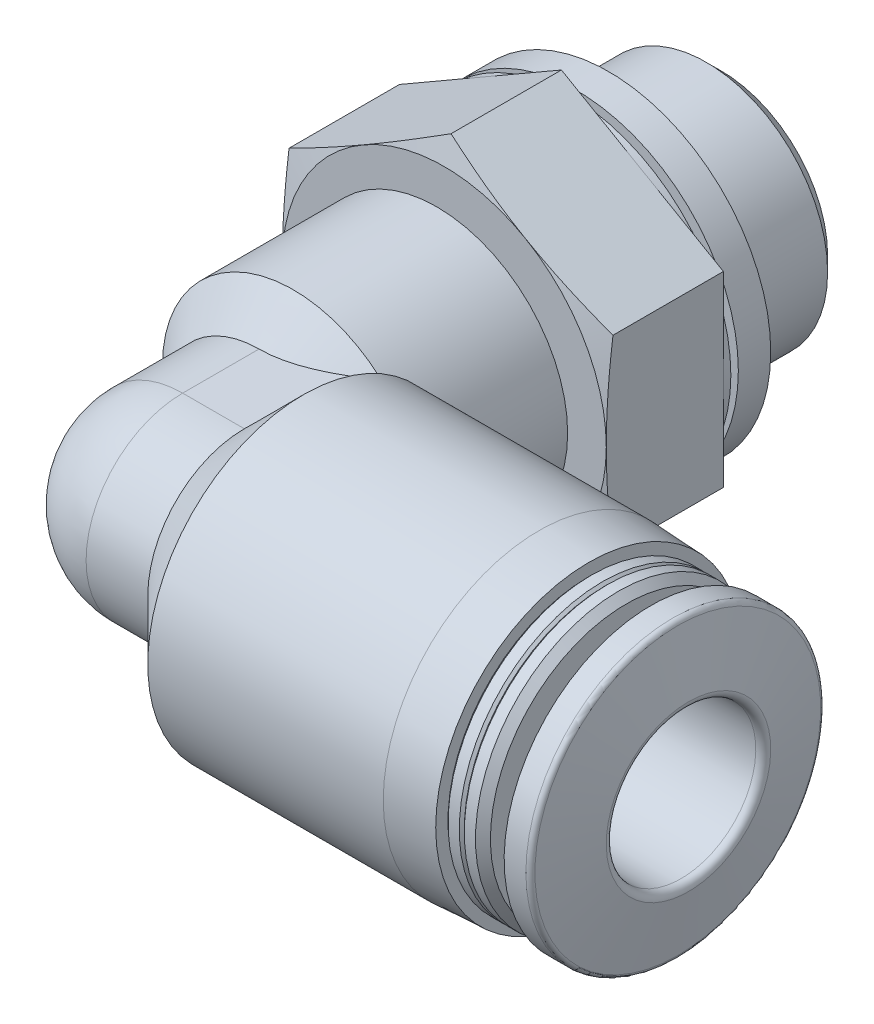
ISO-10303-21;
HEADER;
FILE_DESCRIPTION(('STEP AP214'),'2;1');
FILE_NAME('part.step','',(''),(''),'','','');
FILE_SCHEMA(('AUTOMOTIVE_DESIGN { 1 0 10303 214 1 1 1 1 }'));
ENDSEC;
DATA;
#1=APPLICATION_CONTEXT('core data for automotive mechanical design processes');
#2=APPLICATION_PROTOCOL_DEFINITION('international standard','automotive_design',2000,#1);
#3=PRODUCT_CONTEXT('',#1,'mechanical');
#4=PRODUCT('Part','Part','',(#3));
#5=PRODUCT_RELATED_PRODUCT_CATEGORY('part','',(#4));
#6=PRODUCT_DEFINITION_FORMATION('','',#4);
#7=PRODUCT_DEFINITION_CONTEXT('part definition',#1,'design');
#8=PRODUCT_DEFINITION('design','',#6,#7);
#9=PRODUCT_DEFINITION_SHAPE('','',#8);
#10=(LENGTH_UNIT() NAMED_UNIT(*) SI_UNIT(.MILLI.,.METRE.));
#11=(NAMED_UNIT(*) PLANE_ANGLE_UNIT() SI_UNIT($,.RADIAN.));
#12=(NAMED_UNIT(*) SI_UNIT($,.STERADIAN.) SOLID_ANGLE_UNIT());
#13=UNCERTAINTY_MEASURE_WITH_UNIT(LENGTH_MEASURE(1.E-05),#10,'distance_accuracy_value','');
#14=(GEOMETRIC_REPRESENTATION_CONTEXT(3) GLOBAL_UNCERTAINTY_ASSIGNED_CONTEXT((#13)) GLOBAL_UNIT_ASSIGNED_CONTEXT((#10,
#11,#12)) REPRESENTATION_CONTEXT('',''));
#15=CARTESIAN_POINT('',(0.,0.,0.));
#16=DIRECTION('',(0.,0.,1.));
#17=DIRECTION('',(1.,0.,0.));
#18=AXIS2_PLACEMENT_3D('',#15,#16,#17);
#19=CARTESIAN_POINT('',(0.,2.67581096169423E-13,17.4000000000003));
#20=DIRECTION('',(0.,1.,0.));
#21=DIRECTION('',(1.,0.,0.));
#22=AXIS2_PLACEMENT_3D('',#19,#20,#21);
#23=SPHERICAL_SURFACE('',#22,3.87499999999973);
#24=CARTESIAN_POINT('',(0.,0.,17.4));
#25=DIRECTION('',(1.,0.,0.));
#26=DIRECTION('',(0.,1.,0.));
#27=AXIS2_PLACEMENT_3D('',#24,#25,#26);
#28=CIRCLE('',#27,3.875);
#29=CARTESIAN_POINT('',(0.,3.875,17.4));
#30=VERTEX_POINT('',#29);
#31=CARTESIAN_POINT('',(0.,-3.875,17.4));
#32=VERTEX_POINT('',#31);
#33=EDGE_CURVE('E200',#30,#32,#28,.T.);
#34=ORIENTED_EDGE('',*,*,#33,.F.);
#35=CARTESIAN_POINT('',(0.,0.,17.4000000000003));
#36=DIRECTION('',(0.,0.,-1.));
#37=DIRECTION('',(-1.,0.,0.));
#38=AXIS2_PLACEMENT_3D('',#35,#36,#37);
#39=CIRCLE('',#38,3.875);
#40=EDGE_CURVE('E227',#32,#30,#39,.T.);
#41=ORIENTED_EDGE('',*,*,#40,.F.);
#42=EDGE_LOOP('',(#34,#41));
#43=FACE_BOUND('',#42,.T.);
#44=ADVANCED_FACE('F14',(#43),#23,.T.);
#45=CARTESIAN_POINT('',(0.,0.,17.4000000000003));
#46=DIRECTION('',(0.,0.,-1.));
#47=DIRECTION('',(-1.,0.,0.));
#48=AXIS2_PLACEMENT_3D('',#45,#46,#47);
#49=CYLINDRICAL_SURFACE('',#48,3.875);
#50=ORIENTED_EDGE('',*,*,#40,.T.);
#51=DIRECTION('',(0.,0.,1.));
#52=VECTOR('',#51,1.);
#53=CARTESIAN_POINT('',(0.,3.875,15.18));
#54=LINE('',#53,#52);
#55=CARTESIAN_POINT('',(0.,3.875,14.335));
#56=VERTEX_POINT('',#55);
#57=EDGE_CURVE('E210',#56,#30,#54,.T.);
#58=ORIENTED_EDGE('',*,*,#57,.F.);
#59=CARTESIAN_POINT('',(0.,0.,14.335));
#60=DIRECTION('',(0.,0.,-1.));
#61=DIRECTION('',(-1.,0.,0.));
#62=AXIS2_PLACEMENT_3D('',#59,#60,#61);
#63=CIRCLE('',#62,3.875);
#64=CARTESIAN_POINT('',(0.,-3.875,14.335));
#65=VERTEX_POINT('',#64);
#66=EDGE_CURVE('E190',#65,#56,#63,.T.);
#67=ORIENTED_EDGE('',*,*,#66,.F.);
#68=DIRECTION('',(0.,0.,-1.));
#69=VECTOR('',#68,1.);
#70=CARTESIAN_POINT('',(0.,-3.875,15.18));
#71=LINE('',#70,#69);
#72=EDGE_CURVE('E182',#32,#65,#71,.T.);
#73=ORIENTED_EDGE('',*,*,#72,.F.);
#74=EDGE_LOOP('',(#50,#58,#67,#73));
#75=FACE_BOUND('',#74,.T.);
#76=ADVANCED_FACE('F1296',(#75),#49,.T.);
#77=CARTESIAN_POINT('',(5.15288203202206,-1.,9.80288203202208));
#78=DIRECTION('',(0.,-1.,0.));
#79=DIRECTION('',(1.,0.,0.));
#80=AXIS2_PLACEMENT_3D('',#77,#78,#79);
#81=PLANE('',#80);
#82=DIRECTION('',(-0.707106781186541,0.,-0.707106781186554));
#83=VECTOR('',#82,1.);
#84=CARTESIAN_POINT('',(5.86720034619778,-1.,10.5172003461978));
#85=LINE('',#84,#83);
#86=CARTESIAN_POINT('',(6.58051866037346,-1.,11.2305186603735));
#87=VERTEX_POINT('',#86);
#88=CARTESIAN_POINT('',(5.15388203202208,-1.,9.80388203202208));
#89=VERTEX_POINT('',#88);
#90=EDGE_CURVE('E613',#87,#89,#85,.T.);
#91=ORIENTED_EDGE('',*,*,#90,.F.);
#92=DIRECTION('',(-1.,0.,0.));
#93=VECTOR('',#92,1.);
#94=CARTESIAN_POINT('',(5.86720034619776,-1.,11.2305186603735));
#95=LINE('',#94,#93);
#96=CARTESIAN_POINT('',(5.15388203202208,-1.,11.2305186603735));
#97=VERTEX_POINT('',#96);
#98=EDGE_CURVE('E221',#87,#97,#95,.T.);
#99=ORIENTED_EDGE('',*,*,#98,.T.);
#100=DIRECTION('',(0.,0.,-1.));
#101=VECTOR('',#100,1.);
#102=CARTESIAN_POINT('',(5.15388203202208,-1.,10.5172003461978));
#103=LINE('',#102,#101);
#104=EDGE_CURVE('E225',#97,#89,#103,.T.);
#105=ORIENTED_EDGE('',*,*,#104,.T.);
#106=EDGE_LOOP('',(#91,#99,#105));
#107=FACE_BOUND('',#106,.T.);
#108=ADVANCED_FACE('F1288',(#107),#81,.T.);
#109=CARTESIAN_POINT('',(6.58151866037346,1.,9.80288203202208));
#110=DIRECTION('',(0.,1.,0.));
#111=DIRECTION('',(-1.,0.,0.));
#112=AXIS2_PLACEMENT_3D('',#109,#110,#111);
#113=PLANE('',#112);
#114=DIRECTION('',(0.,0.,1.));
#115=VECTOR('',#114,1.);
#116=CARTESIAN_POINT('',(5.15388203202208,1.,10.5172003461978));
#117=LINE('',#116,#115);
#118=CARTESIAN_POINT('',(5.15388203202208,1.,9.80388203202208));
#119=VERTEX_POINT('',#118);
#120=CARTESIAN_POINT('',(5.15388203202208,1.,11.2305186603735));
#121=VERTEX_POINT('',#120);
#122=EDGE_CURVE('E218',#119,#121,#117,.T.);
#123=ORIENTED_EDGE('',*,*,#122,.T.);
#124=DIRECTION('',(1.,0.,0.));
#125=VECTOR('',#124,1.);
#126=CARTESIAN_POINT('',(5.86720034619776,1.,11.2305186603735));
#127=LINE('',#126,#125);
#128=CARTESIAN_POINT('',(6.58051866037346,1.,11.2305186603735));
#129=VERTEX_POINT('',#128);
#130=EDGE_CURVE('E183',#121,#129,#127,.T.);
#131=ORIENTED_EDGE('',*,*,#130,.T.);
#132=DIRECTION('',(0.707106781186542,0.,0.707106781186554));
#133=VECTOR('',#132,1.);
#134=CARTESIAN_POINT('',(5.86720034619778,1.,10.5172003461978));
#135=LINE('',#134,#133);
#136=EDGE_CURVE('E610',#119,#129,#135,.T.);
#137=ORIENTED_EDGE('',*,*,#136,.F.);
#138=EDGE_LOOP('',(#123,#131,#137));
#139=FACE_BOUND('',#138,.T.);
#140=ADVANCED_FACE('F1282',(#139),#113,.T.);
#141=CARTESIAN_POINT('',(-0.001,-3.875,12.959));
#142=DIRECTION('',(0.,-1.,0.));
#143=DIRECTION('',(1.,0.,0.));
#144=AXIS2_PLACEMENT_3D('',#141,#142,#143);
#145=PLANE('',#144);
#146=DIRECTION('',(1.,0.,0.));
#147=VECTOR('',#146,1.);
#148=CARTESIAN_POINT('',(1.2375,-3.875,17.4));
#149=LINE('',#148,#147);
#150=CARTESIAN_POINT('',(2.47500000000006,-3.875,17.4));
#151=VERTEX_POINT('',#150);
#152=EDGE_CURVE('E194',#32,#151,#149,.T.);
#153=ORIENTED_EDGE('',*,*,#152,.F.);
#154=ORIENTED_EDGE('',*,*,#72,.T.);
#155=CARTESIAN_POINT('',(3.54215682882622,-3.875,12.96));
#156=CARTESIAN_POINT('',(3.45265100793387,-3.875,13.0203767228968));
#157=CARTESIAN_POINT('',(3.3625721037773,-3.875,13.0799176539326));
#158=CARTESIAN_POINT('',(3.18108867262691,-3.875,13.1970060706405));
#159=CARTESIAN_POINT('',(3.0896837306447,-3.875,13.2545529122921));
#160=CARTESIAN_POINT('',(2.90488057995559,-3.875,13.3676258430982));
#161=CARTESIAN_POINT('',(2.81147377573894,-3.875,13.4231379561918));
#162=CARTESIAN_POINT('',(2.62304307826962,-3.875,13.5313206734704));
#163=CARTESIAN_POINT('',(2.52801933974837,-3.875,13.5839915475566));
#164=CARTESIAN_POINT('',(2.24683728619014,-3.875,13.7334845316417));
#165=CARTESIAN_POINT('',(2.05820724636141,-3.875,13.8257510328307));
#166=CARTESIAN_POINT('',(1.67356444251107,-3.875,13.9925852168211));
#167=CARTESIAN_POINT('',(1.47757056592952,-3.875,14.0671950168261));
#168=CARTESIAN_POINT('',(1.17537099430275,-3.875,14.1618318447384));
#169=CARTESIAN_POINT('',(1.07193968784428,-3.875,14.1907424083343));
#170=CARTESIAN_POINT('',(0.863310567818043,-3.875,14.2412857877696));
#171=CARTESIAN_POINT('',(0.75811305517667,-3.875,14.2629198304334));
#172=CARTESIAN_POINT('',(0.544568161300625,-3.875,14.2983604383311));
#173=CARTESIAN_POINT('',(0.436197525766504,-3.875,14.3120300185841));
#174=CARTESIAN_POINT('',(0.273017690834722,-3.875,14.3257739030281));
#175=CARTESIAN_POINT('',(0.218477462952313,-3.875,14.3292285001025));
#176=CARTESIAN_POINT('',(0.109293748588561,-3.875,14.3338433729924));
#177=CARTESIAN_POINT('',(0.0546502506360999,-3.875,14.3350033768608));
#178=CARTESIAN_POINT('',(0.,-3.875,14.335));
#179=B_SPLINE_CURVE_WITH_KNOTS('',3,(#155,#156,#157,#158,#159,#160,#161,#162,#163,#164,#165,
#166,#167,#168,#169,#170,#171,#172,#173,#174,#175,#176,#177,#178),.UNSPECIFIED.,.F.,.F.,(4,2,2,
2,2,2,2,2,2,2,2,4),(0.,0.323904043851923,0.647911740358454,0.973837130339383,1.29973150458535,
1.92907795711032,2.55690772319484,2.87887538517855,3.20078873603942,3.52808679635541,
3.69199282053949,3.8559182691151),.UNSPECIFIED.);
#180=CARTESIAN_POINT('',(3.5421568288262,-3.875,12.96));
#181=VERTEX_POINT('',#180);
#182=EDGE_CURVE('E18',#181,#65,#179,.T.);
#183=ORIENTED_EDGE('',*,*,#182,.F.);
#184=DIRECTION('',(0.,0.,1.));
#185=VECTOR('',#184,1.);
#186=CARTESIAN_POINT('',(3.5421568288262,-3.875,15.18));
#187=LINE('',#186,#185);
#188=CARTESIAN_POINT('',(3.54215682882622,-3.875,14.3325435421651));
#189=VERTEX_POINT('',#188);
#190=EDGE_CURVE('E176',#181,#189,#187,.T.);
#191=ORIENTED_EDGE('',*,*,#190,.T.);
#192=CARTESIAN_POINT('',(2.47500000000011,-3.875,17.4));
#193=CARTESIAN_POINT('',(2.47499519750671,-3.875,17.3404243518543));
#194=CARTESIAN_POINT('',(2.47637459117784,-3.875,17.2808575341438));
#195=CARTESIAN_POINT('',(2.4818566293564,-3.875,17.161858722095));
#196=CARTESIAN_POINT('',(2.4859588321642,-3.875,17.1024267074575));
#197=CARTESIAN_POINT('',(2.50225943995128,-3.875,16.9247325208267));
#198=CARTESIAN_POINT('',(2.51845223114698,-3.875,16.8068172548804));
#199=CARTESIAN_POINT('',(2.56027745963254,-3.875,16.5747735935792));
#200=CARTESIAN_POINT('',(2.58574591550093,-3.875,16.4606148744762));
#201=CARTESIAN_POINT('',(2.64502071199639,-3.875,16.2344593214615));
#202=CARTESIAN_POINT('',(2.67883045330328,-3.875,16.1224633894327));
#203=CARTESIAN_POINT('',(2.76555156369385,-3.875,15.8653378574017));
#204=CARTESIAN_POINT('',(2.82111119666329,-3.875,15.7211060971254));
#205=CARTESIAN_POINT('',(2.94204392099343,-3.875,15.4367618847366));
#206=CARTESIAN_POINT('',(3.00742449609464,-3.875,15.2966526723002));
#207=CARTESIAN_POINT('',(3.1474770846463,-3.875,15.0169489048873));
#208=CARTESIAN_POINT('',(3.2223350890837,-3.875,14.8774481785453));
#209=CARTESIAN_POINT('',(3.33917449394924,-3.875,14.6710169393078));
#210=CARTESIAN_POINT('',(3.37883229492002,-3.875,14.6027520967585));
#211=CARTESIAN_POINT('',(3.45951212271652,-3.875,14.4670486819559));
#212=CARTESIAN_POINT('',(3.50053391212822,-3.875,14.399609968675));
#213=CARTESIAN_POINT('',(3.54215682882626,-3.875,14.3325435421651));
#214=B_SPLINE_CURVE_WITH_KNOTS('',3,(#192,#193,#194,#195,#196,#197,#198,#199,#200,#201,#202,
#203,#204,#205,#206,#207,#208,#209,#210,#211,#212,#213),.UNSPECIFIED.,.F.,.F.,(4,2,2,2,2,2,2,2,
2,2,4),(0.,0.178694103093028,0.357359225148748,0.713927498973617,1.06447596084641,
1.41516757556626,1.87837304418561,2.3419332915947,2.81666843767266,3.05350107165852,
3.29029269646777),.UNSPECIFIED.);
#215=EDGE_CURVE('E612',#151,#189,#214,.T.);
#216=ORIENTED_EDGE('',*,*,#215,.F.);
#217=EDGE_LOOP('',(#153,#154,#183,#191,#216));
#218=FACE_BOUND('',#217,.T.);
#219=ADVANCED_FACE('F187',(#218),#145,.T.);
#220=CARTESIAN_POINT('',(3.54315682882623,3.875,12.959));
#221=DIRECTION('',(0.,1.,0.));
#222=DIRECTION('',(-1.,0.,0.));
#223=AXIS2_PLACEMENT_3D('',#220,#221,#222);
#224=PLANE('',#223);
#225=CARTESIAN_POINT('',(3.54215682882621,3.875,14.332543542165));
#226=CARTESIAN_POINT('',(3.49760425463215,3.875,14.4043318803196));
#227=CARTESIAN_POINT('',(3.45373956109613,3.875,14.4765460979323));
#228=CARTESIAN_POINT('',(3.36758508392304,3.875,14.621928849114));
#229=CARTESIAN_POINT('',(3.32529565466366,3.875,14.6950975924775));
#230=CARTESIAN_POINT('',(3.2008543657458,3.875,14.9166114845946));
#231=CARTESIAN_POINT('',(3.12141670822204,3.875,15.0665070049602));
#232=CARTESIAN_POINT('',(2.97400372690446,3.875,15.3670279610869));
#233=CARTESIAN_POINT('',(2.90578322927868,3.875,15.5175320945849));
#234=CARTESIAN_POINT('',(2.78118648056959,3.875,15.8232548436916));
#235=CARTESIAN_POINT('',(2.72479543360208,3.875,15.9784672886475));
#236=CARTESIAN_POINT('',(2.64448884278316,3.875,16.2374353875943));
#237=CARTESIAN_POINT('',(2.6161608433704,3.875,16.3398229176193));
#238=CARTESIAN_POINT('',(2.56665826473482,3.875,16.5463064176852));
#239=CARTESIAN_POINT('',(2.54548196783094,3.875,16.6504019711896));
#240=CARTESIAN_POINT('',(2.51081305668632,3.875,16.8616252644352));
#241=CARTESIAN_POINT('',(2.49745034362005,3.875,16.9687748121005));
#242=CARTESIAN_POINT('',(2.48401656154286,3.875,17.1301026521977));
#243=CARTESIAN_POINT('',(2.48064030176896,3.875,17.1840210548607));
#244=CARTESIAN_POINT('',(2.47613028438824,3.875,17.2919574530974));
#245=CARTESIAN_POINT('',(2.47499677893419,3.875,17.3459754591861));
#246=CARTESIAN_POINT('',(2.47500000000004,3.875,17.4));
#247=B_SPLINE_CURVE_WITH_KNOTS('',3,(#225,#226,#227,#228,#229,#230,#231,#232,#233,#234,#235,
#236,#237,#238,#239,#240,#241,#242,#243,#244,#245,#246),.UNSPECIFIED.,.F.,.F.,(4,2,2,2,2,2,2,2,
2,2,4),(0.,0.25346060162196,0.506977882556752,1.01563095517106,1.51099979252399,
2.00574529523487,2.32422964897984,2.64263745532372,2.96619844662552,3.1282293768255,
3.29027852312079),.UNSPECIFIED.);
#248=CARTESIAN_POINT('',(3.5421568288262,3.875,14.3325435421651));
#249=VERTEX_POINT('',#248);
#250=CARTESIAN_POINT('',(2.475,3.875,17.4));
#251=VERTEX_POINT('',#250);
#252=EDGE_CURVE('E609',#249,#251,#247,.T.);
#253=ORIENTED_EDGE('',*,*,#252,.F.);
#254=DIRECTION('',(0.,0.,-1.));
#255=VECTOR('',#254,1.);
#256=CARTESIAN_POINT('',(3.5421568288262,3.875,15.18));
#257=LINE('',#256,#255);
#258=CARTESIAN_POINT('',(3.5421568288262,3.875,12.96));
#259=VERTEX_POINT('',#258);
#260=EDGE_CURVE('E208',#249,#259,#257,.T.);
#261=ORIENTED_EDGE('',*,*,#260,.T.);
#262=CARTESIAN_POINT('',(0.,3.875,14.335));
#263=CARTESIAN_POINT('',(0.0595892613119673,3.875,14.3350048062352));
#264=CARTESIAN_POINT('',(0.119169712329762,3.875,14.3336247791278));
#265=CARTESIAN_POINT('',(0.238195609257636,3.875,14.3281402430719));
#266=CARTESIAN_POINT('',(0.297641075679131,3.875,14.3240361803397));
#267=CARTESIAN_POINT('',(0.47537518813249,3.875,14.3077282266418));
#268=CARTESIAN_POINT('',(0.59331661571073,3.875,14.2915281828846));
#269=CARTESIAN_POINT('',(0.825362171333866,3.875,14.2496935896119));
#270=CARTESIAN_POINT('',(0.939497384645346,3.875,14.2242271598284));
#271=CARTESIAN_POINT('',(1.16559807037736,3.875,14.1649617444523));
#272=CARTESIAN_POINT('',(1.27756276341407,3.875,14.1311598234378));
#273=CARTESIAN_POINT('',(1.57796082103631,3.875,14.0298465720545));
#274=CARTESIAN_POINT('',(1.76407545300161,3.875,13.9554706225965));
#275=CARTESIAN_POINT('',(2.12962536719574,3.875,13.7913865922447));
#276=CARTESIAN_POINT('',(2.30904801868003,3.875,13.7016511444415));
#277=CARTESIAN_POINT('',(2.57653244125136,3.875,13.5572261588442));
#278=CARTESIAN_POINT('',(2.66681548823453,3.875,13.5065744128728));
#279=CARTESIAN_POINT('',(2.84593341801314,3.875,13.4027526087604));
#280=CARTESIAN_POINT('',(2.93476818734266,3.875,13.349582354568));
#281=CARTESIAN_POINT('',(3.1107091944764,3.875,13.2413639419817));
#282=CARTESIAN_POINT('',(3.19782156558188,3.875,13.1863257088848));
#283=CARTESIAN_POINT('',(3.37084869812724,3.875,13.0744455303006));
#284=CARTESIAN_POINT('',(3.45676377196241,3.875,13.0176040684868));
#285=CARTESIAN_POINT('',(3.54215682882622,3.875,12.96));
#286=B_SPLINE_CURVE_WITH_KNOTS('',3,(#262,#263,#264,#265,#266,#267,#268,#269,#270,#271,#272,
#273,#274,#275,#276,#277,#278,#279,#280,#281,#282,#283,#284,#285),.UNSPECIFIED.,.F.,.F.,(4,2,2,
2,2,2,2,2,2,2,2,4),(0.,0.178734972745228,0.357440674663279,0.714089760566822,1.06456688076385,
1.41516760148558,2.01541546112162,2.61674416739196,2.92727428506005,3.23782861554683,
3.54693319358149,3.85595555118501),.UNSPECIFIED.);
#287=EDGE_CURVE('E170',#56,#259,#286,.T.);
#288=ORIENTED_EDGE('',*,*,#287,.F.);
#289=ORIENTED_EDGE('',*,*,#57,.T.);
#290=DIRECTION('',(-1.,0.,0.));
#291=VECTOR('',#290,1.);
#292=CARTESIAN_POINT('',(1.2375,3.875,17.4));
#293=LINE('',#292,#291);
#294=EDGE_CURVE('E191',#251,#30,#293,.T.);
#295=ORIENTED_EDGE('',*,*,#294,.F.);
#296=EDGE_LOOP('',(#253,#261,#288,#289,#295));
#297=FACE_BOUND('',#296,.T.);
#298=ADVANCED_FACE('F632',(#297),#224,.T.);
#299=CARTESIAN_POINT('',(2.475,0.,17.4));
#300=DIRECTION('',(-1.,0.,0.));
#301=DIRECTION('',(0.,-1.,0.));
#302=AXIS2_PLACEMENT_3D('',#299,#300,#301);
#303=CYLINDRICAL_SURFACE('',#302,3.875);
#304=CARTESIAN_POINT('',(2.475,0.,17.4));
#305=DIRECTION('',(1.,0.,0.));
#306=DIRECTION('',(0.,1.,0.));
#307=AXIS2_PLACEMENT_3D('',#304,#305,#306);
#308=CIRCLE('',#307,3.875);
#309=EDGE_CURVE('E605',#251,#151,#308,.T.);
#310=ORIENTED_EDGE('',*,*,#309,.F.);
#311=ORIENTED_EDGE('',*,*,#294,.T.);
#312=ORIENTED_EDGE('',*,*,#33,.T.);
#313=ORIENTED_EDGE('',*,*,#152,.T.);
#314=EDGE_LOOP('',(#310,#311,#312,#313));
#315=FACE_BOUND('',#314,.T.);
#316=ADVANCED_FACE('F639',(#315),#303,.T.);
#317=CARTESIAN_POINT('',(0.,0.,12.96));
#318=DIRECTION('',(0.,0.,-1.));
#319=DIRECTION('',(-1.,0.,0.));
#320=AXIS2_PLACEMENT_3D('',#317,#318,#319);
#321=CONICAL_SURFACE('',#320,5.25,0.785398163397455);
#322=ORIENTED_EDGE('',*,*,#66,.T.);
#323=ORIENTED_EDGE('',*,*,#287,.T.);
#324=CARTESIAN_POINT('',(0.,0.,12.96));
#325=DIRECTION('',(0.,0.,-1.));
#326=DIRECTION('',(-1.,0.,0.));
#327=AXIS2_PLACEMENT_3D('',#324,#325,#326);
#328=CIRCLE('',#327,5.25);
#329=EDGE_CURVE('E164',#181,#259,#328,.T.);
#330=ORIENTED_EDGE('',*,*,#329,.F.);
#331=ORIENTED_EDGE('',*,*,#182,.T.);
#332=EDGE_LOOP('',(#322,#323,#330,#331));
#333=FACE_BOUND('',#332,.T.);
#334=ADVANCED_FACE('F167',(#333),#321,.T.);
#335=CARTESIAN_POINT('',(5.15317492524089,-1.001,9.80317492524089));
#336=DIRECTION('',(0.707106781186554,0.,-0.707106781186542));
#337=DIRECTION('',(0.,1.,0.));
#338=AXIS2_PLACEMENT_3D('',#335,#336,#337);
#339=PLANE('',#338);
#340=ORIENTED_EDGE('',*,*,#136,.T.);
#341=CARTESIAN_POINT('',(12.7499999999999,0.,17.4));
#342=DIRECTION('',(0.707106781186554,0.,-0.707106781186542));
#343=DIRECTION('',(-0.707106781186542,0.,-0.707106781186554));
#344=AXIS2_PLACEMENT_3D('',#341,#342,#343);
#345=ELLIPSE('',#344,8.83883476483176,6.25);
#346=EDGE_CURVE('E673',#87,#129,#345,.T.);
#347=ORIENTED_EDGE('',*,*,#346,.F.);
#348=ORIENTED_EDGE('',*,*,#90,.T.);
#349=CARTESIAN_POINT('',(0.,0.,4.64999999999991));
#350=DIRECTION('',(0.707106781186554,0.,-0.707106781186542));
#351=DIRECTION('',(-0.707106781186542,0.,-0.707106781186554));
#352=AXIS2_PLACEMENT_3D('',#349,#350,#351);
#353=ELLIPSE('',#352,7.42462120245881,5.25);
#354=EDGE_CURVE('E608',#119,#89,#353,.T.);
#355=ORIENTED_EDGE('',*,*,#354,.F.);
#356=EDGE_LOOP('',(#340,#347,#348,#355));
#357=FACE_BOUND('',#356,.T.);
#358=ADVANCED_FACE('F638',(#357),#339,.T.);
#359=CARTESIAN_POINT('',(4.85,0.,17.4));
#360=DIRECTION('',(1.,0.,0.));
#361=DIRECTION('',(0.,1.,0.));
#362=AXIS2_PLACEMENT_3D('',#359,#360,#361);
#363=CONICAL_SURFACE('',#362,6.24999999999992,0.785398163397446);
#364=ORIENTED_EDGE('',*,*,#252,.T.);
#365=ORIENTED_EDGE('',*,*,#309,.T.);
#366=ORIENTED_EDGE('',*,*,#215,.T.);
#367=CARTESIAN_POINT('',(4.85,-2.00997512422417,11.4820189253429));
#368=CARTESIAN_POINT('',(4.80095199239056,-2.1282263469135,11.574019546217));
#369=CARTESIAN_POINT('',(4.74933393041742,-2.24065153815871,11.6717566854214));
#370=CARTESIAN_POINT('',(4.64255549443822,-2.45428324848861,11.8765876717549));
#371=CARTESIAN_POINT('',(4.5874033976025,-2.55551456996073,11.9836598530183));
#372=CARTESIAN_POINT('',(4.47593439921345,-2.7459864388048,12.2034763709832));
#373=CARTESIAN_POINT('',(4.41965648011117,-2.83541040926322,12.3160834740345));
#374=CARTESIAN_POINT('',(4.30606743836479,-3.0051154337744,12.5475907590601));
#375=CARTESIAN_POINT('',(4.24875570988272,-3.08539091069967,12.6664947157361));
#376=CARTESIAN_POINT('',(4.13548944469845,-3.23556142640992,12.9067555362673));
#377=CARTESIAN_POINT('',(4.07953491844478,-3.30565731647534,13.0279875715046));
#378=CARTESIAN_POINT('',(3.96849633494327,-3.43816896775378,13.274919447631));
#379=CARTESIAN_POINT('',(3.91341212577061,-3.50058608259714,13.4006184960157));
#380=CARTESIAN_POINT('',(3.80395440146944,-3.61926335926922,13.6584029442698));
#381=CARTESIAN_POINT('',(3.74961238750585,-3.67538979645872,13.7905631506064));
#382=CARTESIAN_POINT('',(3.6436291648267,-3.78047898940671,14.0587394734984));
#383=CARTESIAN_POINT('',(3.59198764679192,-3.82944256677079,14.1947551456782));
#384=CARTESIAN_POINT('',(3.54215682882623,-3.875,14.3325435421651));
#385=B_SPLINE_CURVE_WITH_KNOTS('',3,(#367,#368,#369,#370,#371,#372,#373,#374,#375,#376,#377,
#378,#379,#380,#381,#382,#383,#384),.UNSPECIFIED.,.F.,.F.,(4,2,2,2,2,2,2,2,4),(0.,
0.472393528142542,0.94371845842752,1.40653761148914,1.86963741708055,2.32176705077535,
2.77381686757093,3.23414720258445,3.69442469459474),.UNSPECIFIED.);
#386=CARTESIAN_POINT('',(4.85,-2.00997512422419,11.4820189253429));
#387=VERTEX_POINT('',#386);
#388=EDGE_CURVE('E173',#387,#189,#385,.T.);
#389=ORIENTED_EDGE('',*,*,#388,.F.);
#390=CARTESIAN_POINT('',(4.85,0.,17.4));
#391=DIRECTION('',(1.,0.,0.));
#392=DIRECTION('',(0.,1.,0.));
#393=AXIS2_PLACEMENT_3D('',#390,#391,#392);
#394=CIRCLE('',#393,6.25);
#395=CARTESIAN_POINT('',(4.85,2.00997512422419,11.4820189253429));
#396=VERTEX_POINT('',#395);
#397=EDGE_CURVE('E600',#396,#387,#394,.T.);
#398=ORIENTED_EDGE('',*,*,#397,.F.);
#399=CARTESIAN_POINT('',(3.5421568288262,3.875,14.332543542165));
#400=CARTESIAN_POINT('',(3.57958910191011,3.84078144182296,14.2290207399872));
#401=CARTESIAN_POINT('',(3.6180421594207,3.80463753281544,14.1265213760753));
#402=CARTESIAN_POINT('',(3.6966057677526,3.728351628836,13.9236507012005));
#403=CARTESIAN_POINT('',(3.73671653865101,3.68820910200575,13.8232796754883));
#404=CARTESIAN_POINT('',(3.85923618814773,3.56127385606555,13.524809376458));
#405=CARTESIAN_POINT('',(3.94355809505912,3.46821699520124,13.3300975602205));
#406=CARTESIAN_POINT('',(4.11152530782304,3.26718552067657,12.957134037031));
#407=CARTESIAN_POINT('',(4.19511101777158,3.15976067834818,12.7785596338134));
#408=CARTESIAN_POINT('',(4.36112427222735,2.92635776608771,12.4337794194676));
#409=CARTESIAN_POINT('',(4.44355372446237,2.800415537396,12.2675506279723));
#410=CARTESIAN_POINT('',(4.58113091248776,2.56680918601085,11.9958888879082));
#411=CARTESIAN_POINT('',(4.63734175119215,2.46421116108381,11.8866601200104));
#412=CARTESIAN_POINT('',(4.7466267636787,2.2465355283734,11.6768833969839));
#413=CARTESIAN_POINT('',(4.79965976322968,2.1313333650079,11.5764438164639));
#414=CARTESIAN_POINT('',(4.85,2.00997512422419,11.4820189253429));
#415=B_SPLINE_CURVE_WITH_KNOTS('',3,(#399,#400,#401,#402,#403,#404,#405,#406,#407,#408,#409,
#410,#411,#412,#413,#414),.UNSPECIFIED.,.F.,.F.,(4,2,2,2,2,2,2,4),(0.,0.345776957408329,
0.691599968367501,1.3857285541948,2.05840987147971,2.72980591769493,3.20928181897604,
3.69401763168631),.UNSPECIFIED.);
#416=EDGE_CURVE('E172',#249,#396,#415,.T.);
#417=ORIENTED_EDGE('',*,*,#416,.F.);
#418=EDGE_LOOP('',(#364,#365,#366,#389,#398,#417));
#419=FACE_BOUND('',#418,.T.);
#420=ADVANCED_FACE('F642',(#419),#363,.T.);
#421=CARTESIAN_POINT('',(0.,0.,14.332543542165));
#422=DIRECTION('',(0.,0.,-1.));
#423=DIRECTION('',(-1.,0.,0.));
#424=AXIS2_PLACEMENT_3D('',#421,#422,#423);
#425=CYLINDRICAL_SURFACE('',#424,5.25);
#426=CARTESIAN_POINT('',(0.,0.,7.2));
#427=DIRECTION('',(0.,0.,-1.));
#428=DIRECTION('',(-1.,0.,0.));
#429=AXIS2_PLACEMENT_3D('',#426,#427,#428);
#430=CIRCLE('',#429,5.25);
#431=CARTESIAN_POINT('',(-5.25,0.,7.2));
#432=VERTEX_POINT('',#431);
#433=EDGE_CURVE('E597',#432,#432,#430,.T.);
#434=ORIENTED_EDGE('',*,*,#433,.F.);
#435=EDGE_LOOP('',(#434));
#436=FACE_BOUND('',#435,.T.);
#437=ORIENTED_EDGE('',*,*,#416,.T.);
#438=CARTESIAN_POINT('',(5.15388203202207,1.,11.2305186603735));
#439=CARTESIAN_POINT('',(5.1368140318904,1.08799347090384,11.2447756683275));
#440=CARTESIAN_POINT('',(5.11754008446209,1.1752518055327,11.2608567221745));
#441=CARTESIAN_POINT('',(5.07484699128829,1.34769209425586,11.2964003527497));
#442=CARTESIAN_POINT('',(5.05144354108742,1.43288056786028,11.3158501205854));
#443=CARTESIAN_POINT('',(5.00062975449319,1.60122926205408,11.3579725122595));
#444=CARTESIAN_POINT('',(4.97321965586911,1.68438960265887,11.3806449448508));
#445=CARTESIAN_POINT('',(4.91448666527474,1.84877666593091,11.429078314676));
#446=CARTESIAN_POINT('',(4.88314953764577,1.9299950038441,11.4548504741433));
#447=CARTESIAN_POINT('',(4.85,2.0099751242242,11.4820189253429));
#448=B_SPLINE_CURVE_WITH_KNOTS('',3,(#438,#439,#440,#441,#442,#443,#444,#445,#446,#447),
.UNSPECIFIED.,.F.,.F.,(4,2,2,2,4),(0.,0.272216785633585,0.543420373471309,0.814607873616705,
1.08680853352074),.UNSPECIFIED.);
#449=EDGE_CURVE('E603',#121,#396,#448,.T.);
#450=ORIENTED_EDGE('',*,*,#449,.F.);
#451=ORIENTED_EDGE('',*,*,#122,.F.);
#452=ORIENTED_EDGE('',*,*,#354,.T.);
#453=ORIENTED_EDGE('',*,*,#104,.F.);
#454=CARTESIAN_POINT('',(4.85,-2.00997512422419,11.4820189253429));
#455=CARTESIAN_POINT('',(4.88314953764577,-1.92999500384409,11.4548504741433));
#456=CARTESIAN_POINT('',(4.91448666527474,-1.84877666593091,11.429078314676));
#457=CARTESIAN_POINT('',(4.97321965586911,-1.68438960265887,11.3806449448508));
#458=CARTESIAN_POINT('',(5.00062975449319,-1.60122926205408,11.3579725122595));
#459=CARTESIAN_POINT('',(5.05144354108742,-1.43288056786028,11.3158501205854));
#460=CARTESIAN_POINT('',(5.07484699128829,-1.34769209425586,11.2964003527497));
#461=CARTESIAN_POINT('',(5.11754008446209,-1.1752518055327,11.2608567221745));
#462=CARTESIAN_POINT('',(5.1368140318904,-1.08799347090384,11.2447756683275));
#463=CARTESIAN_POINT('',(5.15388203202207,-1.,11.2305186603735));
#464=B_SPLINE_CURVE_WITH_KNOTS('',3,(#454,#455,#456,#457,#458,#459,#460,#461,#462,#463),
.UNSPECIFIED.,.F.,.F.,(4,2,2,2,4),(0.,0.272200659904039,0.543388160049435,0.81459174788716,
1.08680853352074),.UNSPECIFIED.);
#465=EDGE_CURVE('E679',#387,#97,#464,.T.);
#466=ORIENTED_EDGE('',*,*,#465,.F.);
#467=ORIENTED_EDGE('',*,*,#388,.T.);
#468=ORIENTED_EDGE('',*,*,#190,.F.);
#469=ORIENTED_EDGE('',*,*,#329,.T.);
#470=ORIENTED_EDGE('',*,*,#260,.F.);
#471=EDGE_LOOP('',(#437,#450,#451,#452,#453,#466,#467,#468,#469,#470));
#472=FACE_BOUND('',#471,.T.);
#473=ADVANCED_FACE('F177',(#436,#472),#425,.T.);
#474=CARTESIAN_POINT('',(14.3,0.,17.4));
#475=DIRECTION('',(-1.,0.,0.));
#476=DIRECTION('',(0.,0.,1.));
#477=AXIS2_PLACEMENT_3D('',#474,#475,#476);
#478=CYLINDRICAL_SURFACE('',#477,6.25);
#479=ORIENTED_EDGE('',*,*,#397,.T.);
#480=ORIENTED_EDGE('',*,*,#465,.T.);
#481=ORIENTED_EDGE('',*,*,#98,.F.);
#482=ORIENTED_EDGE('',*,*,#346,.T.);
#483=ORIENTED_EDGE('',*,*,#130,.F.);
#484=ORIENTED_EDGE('',*,*,#449,.T.);
#485=EDGE_LOOP('',(#479,#480,#481,#482,#483,#484));
#486=FACE_BOUND('',#485,.T.);
#487=CARTESIAN_POINT('',(14.3,0.,17.4));
#488=DIRECTION('',(1.,0.,0.));
#489=DIRECTION('',(0.,0.,-1.));
#490=AXIS2_PLACEMENT_3D('',#487,#488,#489);
#491=CIRCLE('',#490,6.25);
#492=CARTESIAN_POINT('',(14.3,0.,11.15));
#493=VERTEX_POINT('',#492);
#494=EDGE_CURVE('E593',#493,#493,#491,.T.);
#495=ORIENTED_EDGE('',*,*,#494,.F.);
#496=EDGE_LOOP('',(#495));
#497=FACE_BOUND('',#496,.T.);
#498=ADVANCED_FACE('F676',(#486,#497),#478,.T.);
#499=CARTESIAN_POINT('',(0.,0.,7.2));
#500=DIRECTION('',(0.,0.,1.));
#501=DIRECTION('',(1.,0.,0.));
#502=AXIS2_PLACEMENT_3D('',#499,#500,#501);
#503=CONICAL_SURFACE('',#502,5.25,1.05165021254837);
#504=CARTESIAN_POINT('',(0.,0.,6.9));
#505=DIRECTION('',(0.,0.,1.));
#506=DIRECTION('',(1.,0.,0.));
#507=AXIS2_PLACEMENT_3D('',#504,#505,#506);
#508=CIRCLE('',#507,4.725);
#509=CARTESIAN_POINT('',(4.725,0.,6.9));
#510=VERTEX_POINT('',#509);
#511=EDGE_CURVE('E596',#510,#510,#508,.F.);
#512=ORIENTED_EDGE('',*,*,#511,.F.);
#513=EDGE_LOOP('',(#512));
#514=FACE_BOUND('',#513,.T.);
#515=ORIENTED_EDGE('',*,*,#433,.T.);
#516=EDGE_LOOP('',(#515));
#517=FACE_BOUND('',#516,.T.);
#518=ADVANCED_FACE('F694',(#514,#517),#503,.T.);
#519=CARTESIAN_POINT('',(14.3,0.,17.4));
#520=DIRECTION('',(-1.,0.,0.));
#521=DIRECTION('',(0.,0.,1.));
#522=AXIS2_PLACEMENT_3D('',#519,#520,#521);
#523=CONICAL_SURFACE('',#522,6.25,0.0523598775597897);
#524=CARTESIAN_POINT('',(16.3,0.,17.4));
#525=DIRECTION('',(-1.,0.,0.));
#526=DIRECTION('',(0.,0.,1.));
#527=AXIS2_PLACEMENT_3D('',#524,#525,#526);
#528=CIRCLE('',#527,6.145184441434);
#529=CARTESIAN_POINT('',(16.3,0.,23.545184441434));
#530=VERTEX_POINT('',#529);
#531=EDGE_CURVE('E726',#530,#530,#528,.F.);
#532=ORIENTED_EDGE('',*,*,#531,.F.);
#533=EDGE_LOOP('',(#532));
#534=FACE_BOUND('',#533,.T.);
#535=ORIENTED_EDGE('',*,*,#494,.T.);
#536=EDGE_LOOP('',(#535));
#537=FACE_BOUND('',#536,.T.);
#538=ADVANCED_FACE('F698',(#534,#537),#523,.T.);
#539=CARTESIAN_POINT('',(-6.501,-7.5065534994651,6.9));
#540=DIRECTION('',(0.,0.,1.));
#541=DIRECTION('',(1.,0.,0.));
#542=AXIS2_PLACEMENT_3D('',#539,#540,#541);
#543=PLANE('',#542);
#544=ORIENTED_EDGE('',*,*,#511,.T.);
#545=EDGE_LOOP('',(#544));
#546=FACE_BOUND('',#545,.T.);
#547=CARTESIAN_POINT('',(0.,0.,6.9));
#548=DIRECTION('',(0.,0.,-1.));
#549=DIRECTION('',(-1.,0.,0.));
#550=AXIS2_PLACEMENT_3D('',#547,#548,#549);
#551=CIRCLE('',#550,6.5);
#552=CARTESIAN_POINT('',(3.24999999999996,-5.62916512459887,6.9));
#553=VERTEX_POINT('',#552);
#554=CARTESIAN_POINT('',(-3.24999999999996,-5.62916512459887,6.9));
#555=VERTEX_POINT('',#554);
#556=EDGE_CURVE('E714',#553,#555,#551,.T.);
#557=ORIENTED_EDGE('',*,*,#556,.F.);
#558=CARTESIAN_POINT('',(0.,0.,6.9));
#559=DIRECTION('',(0.,0.,-1.));
#560=DIRECTION('',(-1.,0.,0.));
#561=AXIS2_PLACEMENT_3D('',#558,#559,#560);
#562=CIRCLE('',#561,6.5);
#563=CARTESIAN_POINT('',(6.5,0.,6.9));
#564=VERTEX_POINT('',#563);
#565=EDGE_CURVE('E716',#564,#553,#562,.T.);
#566=ORIENTED_EDGE('',*,*,#565,.F.);
#567=CARTESIAN_POINT('',(0.,0.,6.9));
#568=DIRECTION('',(0.,0.,-1.));
#569=DIRECTION('',(-1.,0.,0.));
#570=AXIS2_PLACEMENT_3D('',#567,#568,#569);
#571=CIRCLE('',#570,6.5);
#572=CARTESIAN_POINT('',(3.24999999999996,5.62916512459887,6.9));
#573=VERTEX_POINT('',#572);
#574=EDGE_CURVE('E733',#573,#564,#571,.T.);
#575=ORIENTED_EDGE('',*,*,#574,.F.);
#576=CARTESIAN_POINT('',(0.,0.,6.9));
#577=DIRECTION('',(0.,0.,-1.));
#578=DIRECTION('',(-1.,0.,0.));
#579=AXIS2_PLACEMENT_3D('',#576,#577,#578);
#580=CIRCLE('',#579,6.5);
#581=CARTESIAN_POINT('',(-3.24999999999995,5.62916512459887,6.9));
#582=VERTEX_POINT('',#581);
#583=EDGE_CURVE('E735',#582,#573,#580,.T.);
#584=ORIENTED_EDGE('',*,*,#583,.F.);
#585=CARTESIAN_POINT('',(0.,0.,6.9));
#586=DIRECTION('',(0.,0.,-1.));
#587=DIRECTION('',(-1.,0.,0.));
#588=AXIS2_PLACEMENT_3D('',#585,#586,#587);
#589=CIRCLE('',#588,6.5);
#590=CARTESIAN_POINT('',(-6.5,0.,6.9));
#591=VERTEX_POINT('',#590);
#592=EDGE_CURVE('E737',#591,#582,#589,.T.);
#593=ORIENTED_EDGE('',*,*,#592,.F.);
#594=CARTESIAN_POINT('',(0.,0.,6.9));
#595=DIRECTION('',(0.,0.,-1.));
#596=DIRECTION('',(-1.,0.,0.));
#597=AXIS2_PLACEMENT_3D('',#594,#595,#596);
#598=CIRCLE('',#597,6.5);
#599=EDGE_CURVE('E719',#555,#591,#598,.T.);
#600=ORIENTED_EDGE('',*,*,#599,.F.);
#601=EDGE_LOOP('',(#557,#566,#575,#584,#593,#600));
#602=FACE_BOUND('',#601,.T.);
#603=ADVANCED_FACE('F701',(#546,#602),#543,.T.);
#604=CARTESIAN_POINT('',(16.3,-6.146184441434,11.253815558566));
#605=DIRECTION('',(1.,0.,0.));
#606=DIRECTION('',(0.,1.,0.));
#607=AXIS2_PLACEMENT_3D('',#604,#605,#606);
#608=PLANE('',#607);
#609=CARTESIAN_POINT('',(16.3,0.,17.4));
#610=DIRECTION('',(1.,0.,0.));
#611=DIRECTION('',(0.,1.,0.));
#612=AXIS2_PLACEMENT_3D('',#609,#610,#611);
#613=CIRCLE('',#612,5.65);
#614=CARTESIAN_POINT('',(16.3,5.65,17.4));
#615=VERTEX_POINT('',#614);
#616=EDGE_CURVE('E388',#615,#615,#613,.T.);
#617=ORIENTED_EDGE('',*,*,#616,.F.);
#618=EDGE_LOOP('',(#617));
#619=FACE_BOUND('',#618,.T.);
#620=ORIENTED_EDGE('',*,*,#531,.T.);
#621=EDGE_LOOP('',(#620));
#622=FACE_BOUND('',#621,.T.);
#623=ADVANCED_FACE('F431',(#619,#622),#608,.T.);
#624=CARTESIAN_POINT('',(0.,0.,6.63056275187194));
#625=DIRECTION('',(0.,0.,-1.));
#626=DIRECTION('',(-1.,0.,0.));
#627=AXIS2_PLACEMENT_3D('',#624,#625,#626);
#628=CONICAL_SURFACE('',#627,7.50555349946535,1.30899693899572);
#629=CARTESIAN_POINT('',(6.5,-3.75277674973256,6.63056275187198));
#630=CARTESIAN_POINT('',(6.23057470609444,-3.90832951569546,6.67225704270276));
#631=CARTESIAN_POINT('',(5.96066581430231,-4.06416148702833,6.71011748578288));
#632=CARTESIAN_POINT('',(5.42031350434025,-4.37613403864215,6.77660530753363));
#633=CARTESIAN_POINT('',(5.14987104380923,-4.53227406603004,6.80524314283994));
#634=CARTESIAN_POINT('',(4.60820672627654,-4.84500410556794,6.85182768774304));
#635=CARTESIAN_POINT('',(4.33698470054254,-5.00159421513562,6.86977187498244));
#636=CARTESIAN_POINT('',(3.92971405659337,-5.23673203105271,6.88784342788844));
#637=CARTESIAN_POINT('',(3.7938049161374,-5.31519920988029,6.89239322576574));
#638=CARTESIAN_POINT('',(3.5219317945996,-5.47216522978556,6.89847513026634));
#639=CARTESIAN_POINT('',(3.38596781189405,-5.5506640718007,6.90000713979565));
#640=CARTESIAN_POINT('',(3.24999999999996,-5.62916512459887,6.9));
#641=B_SPLINE_CURVE_WITH_KNOTS('',3,(#629,#630,#631,#632,#633,#634,#635,#636,#637,#638,#639,
#640),.UNSPECIFIED.,.F.,.F.,(4,2,2,2,2,4),(0.,0.941701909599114,1.88233232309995,
2.82318451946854,3.29415983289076,3.76515029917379),.UNSPECIFIED.);
#642=CARTESIAN_POINT('',(6.5,-3.75277674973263,6.63056275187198));
#643=VERTEX_POINT('',#642);
#644=EDGE_CURVE('E419',#643,#553,#641,.T.);
#645=ORIENTED_EDGE('',*,*,#644,.F.);
#646=CARTESIAN_POINT('',(6.5,0.,6.9));
#647=CARTESIAN_POINT('',(6.5,-0.157002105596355,6.90000713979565));
#648=CARTESIAN_POINT('',(6.5,-0.313999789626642,6.89847513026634));
#649=CARTESIAN_POINT('',(6.5,-0.627931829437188,6.89239322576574));
#650=CARTESIAN_POINT('',(6.5,-0.784866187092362,6.88784342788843));
#651=CARTESIAN_POINT('',(6.5,-1.25514181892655,6.86977187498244));
#652=CARTESIAN_POINT('',(6.5,-1.56832203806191,6.85182768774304));
#653=CARTESIAN_POINT('',(6.5,-2.19378211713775,6.80524314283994));
#654=CARTESIAN_POINT('',(6.5,-2.50606217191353,6.77660530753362));
#655=CARTESIAN_POINT('',(6.5,-3.1300072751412,6.71011748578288));
#656=CARTESIAN_POINT('',(6.5,-3.44167121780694,6.67225704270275));
#657=CARTESIAN_POINT('',(6.5,-3.75277674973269,6.63056275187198));
#658=B_SPLINE_CURVE_WITH_KNOTS('',3,(#646,#647,#648,#649,#650,#651,#652,#653,#654,#655,#656,
#657),.UNSPECIFIED.,.F.,.F.,(4,2,2,2,2,4),(0.,0.470990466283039,0.941965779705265,
1.88281797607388,2.82344838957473,3.76515029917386),.UNSPECIFIED.);
#659=EDGE_CURVE('E387',#564,#643,#658,.T.);
#660=ORIENTED_EDGE('',*,*,#659,.F.);
#661=ORIENTED_EDGE('',*,*,#565,.T.);
#662=EDGE_LOOP('',(#645,#660,#661));
#663=FACE_BOUND('',#662,.T.);
#664=ADVANCED_FACE('F426',(#663),#628,.T.);
#665=CARTESIAN_POINT('',(0.,0.,6.63056275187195));
#666=DIRECTION('',(0.,0.,-1.));
#667=DIRECTION('',(-1.,0.,0.));
#668=AXIS2_PLACEMENT_3D('',#665,#666,#667);
#669=CONICAL_SURFACE('',#668,7.50555349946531,1.30899693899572);
#670=CARTESIAN_POINT('',(0.,-7.50555349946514,6.63056275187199));
#671=CARTESIAN_POINT('',(-0.269425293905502,-7.35000073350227,6.67225704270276));
#672=CARTESIAN_POINT('',(-0.539334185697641,-7.19416876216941,6.71011748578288));
#673=CARTESIAN_POINT('',(-1.07968649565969,-6.88219621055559,6.77660530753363));
#674=CARTESIAN_POINT('',(-1.35012895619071,-6.72605618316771,6.80524314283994));
#675=CARTESIAN_POINT('',(-1.8917932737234,-6.4133261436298,6.85182768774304));
#676=CARTESIAN_POINT('',(-2.16301529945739,-6.25673603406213,6.86977187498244));
#677=CARTESIAN_POINT('',(-2.57028594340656,-6.02159821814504,6.88784342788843));
#678=CARTESIAN_POINT('',(-2.70619508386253,-5.94313103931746,6.89239322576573));
#679=CARTESIAN_POINT('',(-2.97806820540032,-5.78616501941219,6.89847513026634));
#680=CARTESIAN_POINT('',(-3.11403218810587,-5.70766617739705,6.90000713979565));
#681=CARTESIAN_POINT('',(-3.24999999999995,-5.62916512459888,6.9));
#682=B_SPLINE_CURVE_WITH_KNOTS('',3,(#670,#671,#672,#673,#674,#675,#676,#677,#678,#679,#680,
#681),.UNSPECIFIED.,.F.,.F.,(4,2,2,2,2,4),(0.,0.941701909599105,1.88233232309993,
2.82318451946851,3.29415983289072,3.76515029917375),.UNSPECIFIED.);
#683=CARTESIAN_POINT('',(0.,-7.50555349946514,6.63056275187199));
#684=VERTEX_POINT('',#683);
#685=EDGE_CURVE('E442',#684,#555,#682,.T.);
#686=ORIENTED_EDGE('',*,*,#685,.F.);
#687=CARTESIAN_POINT('',(3.24999999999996,-5.62916512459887,6.9));
#688=CARTESIAN_POINT('',(3.11403218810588,-5.70766617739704,6.90000713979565));
#689=CARTESIAN_POINT('',(2.97806820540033,-5.78616501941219,6.89847513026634));
#690=CARTESIAN_POINT('',(2.70619508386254,-5.94313103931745,6.89239322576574));
#691=CARTESIAN_POINT('',(2.57028594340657,-6.02159821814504,6.88784342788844));
#692=CARTESIAN_POINT('',(2.16301529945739,-6.25673603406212,6.86977187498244));
#693=CARTESIAN_POINT('',(1.8917932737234,-6.41332614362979,6.85182768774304));
#694=CARTESIAN_POINT('',(1.35012895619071,-6.7260561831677,6.80524314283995));
#695=CARTESIAN_POINT('',(1.07968649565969,-6.88219621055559,6.77660530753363));
#696=CARTESIAN_POINT('',(0.539334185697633,-7.19416876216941,6.71011748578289));
#697=CARTESIAN_POINT('',(0.269425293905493,-7.35000073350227,6.67225704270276));
#698=CARTESIAN_POINT('',(0.,-7.50555349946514,6.63056275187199));
#699=B_SPLINE_CURVE_WITH_KNOTS('',3,(#687,#688,#689,#690,#691,#692,#693,#694,#695,#696,#697,
#698),.UNSPECIFIED.,.F.,.F.,(4,2,2,2,2,4),(0.,0.470990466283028,0.941965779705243,
1.88281797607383,2.82344838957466,3.76515029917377),.UNSPECIFIED.);
#700=EDGE_CURVE('E412',#553,#684,#699,.T.);
#701=ORIENTED_EDGE('',*,*,#700,.F.);
#702=ORIENTED_EDGE('',*,*,#556,.T.);
#703=EDGE_LOOP('',(#686,#701,#702));
#704=FACE_BOUND('',#703,.T.);
#705=ADVANCED_FACE('F430',(#704),#669,.T.);
#706=CARTESIAN_POINT('',(0.,0.,6.63056275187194));
#707=DIRECTION('',(0.,0.,-1.));
#708=DIRECTION('',(-1.,0.,0.));
#709=AXIS2_PLACEMENT_3D('',#706,#707,#708);
#710=CONICAL_SURFACE('',#709,7.50555349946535,1.30899693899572);
#711=CARTESIAN_POINT('',(-3.24999999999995,-5.62916512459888,6.9));
#712=CARTESIAN_POINT('',(-3.38596781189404,-5.55066407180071,6.90000713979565));
#713=CARTESIAN_POINT('',(-3.52193179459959,-5.47216522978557,6.89847513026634));
#714=CARTESIAN_POINT('',(-3.79380491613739,-5.3151992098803,6.89239322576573));
#715=CARTESIAN_POINT('',(-3.92971405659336,-5.23673203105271,6.88784342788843));
#716=CARTESIAN_POINT('',(-4.33698470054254,-5.00159421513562,6.86977187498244));
#717=CARTESIAN_POINT('',(-4.60820672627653,-4.84500410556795,6.85182768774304));
#718=CARTESIAN_POINT('',(-5.14987104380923,-4.53227406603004,6.80524314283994));
#719=CARTESIAN_POINT('',(-5.42031350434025,-4.37613403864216,6.77660530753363));
#720=CARTESIAN_POINT('',(-5.9606658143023,-4.06416148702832,6.71011748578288));
#721=CARTESIAN_POINT('',(-6.23057470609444,-3.90832951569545,6.67225704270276));
#722=CARTESIAN_POINT('',(-6.5,-3.75277674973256,6.63056275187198));
#723=B_SPLINE_CURVE_WITH_KNOTS('',3,(#711,#712,#713,#714,#715,#716,#717,#718,#719,#720,#721,
#722),.UNSPECIFIED.,.F.,.F.,(4,2,2,2,2,4),(0.,0.470990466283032,0.94196577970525,
1.88281797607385,2.82344838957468,3.7651502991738),.UNSPECIFIED.);
#724=CARTESIAN_POINT('',(-6.5,-3.75277674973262,6.63056275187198));
#725=VERTEX_POINT('',#724);
#726=EDGE_CURVE('E449',#555,#725,#723,.T.);
#727=ORIENTED_EDGE('',*,*,#726,.F.);
#728=ORIENTED_EDGE('',*,*,#599,.T.);
#729=CARTESIAN_POINT('',(-6.5,-3.75277674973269,6.63056275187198));
#730=CARTESIAN_POINT('',(-6.5,-3.44167121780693,6.67225704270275));
#731=CARTESIAN_POINT('',(-6.5,-3.1300072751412,6.71011748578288));
#732=CARTESIAN_POINT('',(-6.5,-2.50606217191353,6.77660530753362));
#733=CARTESIAN_POINT('',(-6.5,-2.19378211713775,6.80524314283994));
#734=CARTESIAN_POINT('',(-6.5,-1.5683220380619,6.85182768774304));
#735=CARTESIAN_POINT('',(-6.5,-1.25514181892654,6.86977187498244));
#736=CARTESIAN_POINT('',(-6.5,-0.784866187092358,6.88784342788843));
#737=CARTESIAN_POINT('',(-6.5,-0.627931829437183,6.89239322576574));
#738=CARTESIAN_POINT('',(-6.5,-0.313999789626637,6.89847513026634));
#739=CARTESIAN_POINT('',(-6.5,-0.15700210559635,6.90000713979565));
#740=CARTESIAN_POINT('',(-6.5,0.,6.9));
#741=B_SPLINE_CURVE_WITH_KNOTS('',3,(#729,#730,#731,#732,#733,#734,#735,#736,#737,#738,#739,
#740),.UNSPECIFIED.,.F.,.F.,(4,2,2,2,2,4),(0.,0.941701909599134,1.88233232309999,
2.8231845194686,3.29415983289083,3.76515029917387),.UNSPECIFIED.);
#742=EDGE_CURVE('E457',#725,#591,#741,.T.);
#743=ORIENTED_EDGE('',*,*,#742,.F.);
#744=EDGE_LOOP('',(#727,#728,#743));
#745=FACE_BOUND('',#744,.T.);
#746=ADVANCED_FACE('F438',(#745),#710,.T.);
#747=CARTESIAN_POINT('',(0.,0.,6.63056275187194));
#748=DIRECTION('',(0.,0.,-1.));
#749=DIRECTION('',(-1.,0.,0.));
#750=AXIS2_PLACEMENT_3D('',#747,#748,#749);
#751=CONICAL_SURFACE('',#750,7.50555349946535,1.30899693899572);
#752=CARTESIAN_POINT('',(-6.5,3.75277674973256,6.63056275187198));
#753=CARTESIAN_POINT('',(-6.23057470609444,3.90832951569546,6.67225704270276));
#754=CARTESIAN_POINT('',(-5.96066581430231,4.06416148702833,6.71011748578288));
#755=CARTESIAN_POINT('',(-5.42031350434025,4.37613403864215,6.77660530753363));
#756=CARTESIAN_POINT('',(-5.14987104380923,4.53227406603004,6.80524314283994));
#757=CARTESIAN_POINT('',(-4.60820672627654,4.84500410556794,6.85182768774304));
#758=CARTESIAN_POINT('',(-4.33698470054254,5.00159421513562,6.86977187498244));
#759=CARTESIAN_POINT('',(-3.92971405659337,5.23673203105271,6.88784342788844));
#760=CARTESIAN_POINT('',(-3.7938049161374,5.31519920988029,6.89239322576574));
#761=CARTESIAN_POINT('',(-3.5219317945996,5.47216522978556,6.89847513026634));
#762=CARTESIAN_POINT('',(-3.38596781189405,5.5506640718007,6.90000713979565));
#763=CARTESIAN_POINT('',(-3.24999999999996,5.62916512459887,6.9));
#764=B_SPLINE_CURVE_WITH_KNOTS('',3,(#752,#753,#754,#755,#756,#757,#758,#759,#760,#761,#762,
#763),.UNSPECIFIED.,.F.,.F.,(4,2,2,2,2,4),(0.,0.941701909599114,1.88233232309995,
2.82318451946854,3.29415983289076,3.76515029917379),.UNSPECIFIED.);
#765=CARTESIAN_POINT('',(-6.5,3.75277674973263,6.63056275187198));
#766=VERTEX_POINT('',#765);
#767=EDGE_CURVE('E485',#766,#582,#764,.T.);
#768=ORIENTED_EDGE('',*,*,#767,.F.);
#769=CARTESIAN_POINT('',(-6.5,0.,6.9));
#770=CARTESIAN_POINT('',(-6.5,0.157002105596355,6.90000713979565));
#771=CARTESIAN_POINT('',(-6.5,0.313999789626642,6.89847513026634));
#772=CARTESIAN_POINT('',(-6.5,0.627931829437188,6.89239322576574));
#773=CARTESIAN_POINT('',(-6.5,0.784866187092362,6.88784342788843));
#774=CARTESIAN_POINT('',(-6.5,1.25514181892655,6.86977187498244));
#775=CARTESIAN_POINT('',(-6.5,1.56832203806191,6.85182768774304));
#776=CARTESIAN_POINT('',(-6.5,2.19378211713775,6.80524314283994));
#777=CARTESIAN_POINT('',(-6.5,2.50606217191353,6.77660530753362));
#778=CARTESIAN_POINT('',(-6.5,3.1300072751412,6.71011748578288));
#779=CARTESIAN_POINT('',(-6.5,3.44167121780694,6.67225704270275));
#780=CARTESIAN_POINT('',(-6.5,3.75277674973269,6.63056275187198));
#781=B_SPLINE_CURVE_WITH_KNOTS('',3,(#769,#770,#771,#772,#773,#774,#775,#776,#777,#778,#779,
#780),.UNSPECIFIED.,.F.,.F.,(4,2,2,2,2,4),(0.,0.470990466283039,0.941965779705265,
1.88281797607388,2.82344838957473,3.76515029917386),.UNSPECIFIED.);
#782=EDGE_CURVE('E464',#591,#766,#781,.T.);
#783=ORIENTED_EDGE('',*,*,#782,.F.);
#784=ORIENTED_EDGE('',*,*,#592,.T.);
#785=EDGE_LOOP('',(#768,#783,#784));
#786=FACE_BOUND('',#785,.T.);
#787=ADVANCED_FACE('F492',(#786),#751,.T.);
#788=CARTESIAN_POINT('',(0.,0.,6.63056275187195));
#789=DIRECTION('',(0.,0.,-1.));
#790=DIRECTION('',(-1.,0.,0.));
#791=AXIS2_PLACEMENT_3D('',#788,#789,#790);
#792=CONICAL_SURFACE('',#791,7.50555349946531,1.30899693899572);
#793=CARTESIAN_POINT('',(0.,7.50555349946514,6.63056275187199));
#794=CARTESIAN_POINT('',(0.269425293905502,7.35000073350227,6.67225704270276));
#795=CARTESIAN_POINT('',(0.539334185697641,7.19416876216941,6.71011748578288));
#796=CARTESIAN_POINT('',(1.07968649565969,6.88219621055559,6.77660530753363));
#797=CARTESIAN_POINT('',(1.35012895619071,6.72605618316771,6.80524314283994));
#798=CARTESIAN_POINT('',(1.8917932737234,6.4133261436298,6.85182768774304));
#799=CARTESIAN_POINT('',(2.16301529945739,6.25673603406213,6.86977187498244));
#800=CARTESIAN_POINT('',(2.57028594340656,6.02159821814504,6.88784342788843));
#801=CARTESIAN_POINT('',(2.70619508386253,5.94313103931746,6.89239322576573));
#802=CARTESIAN_POINT('',(2.97806820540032,5.78616501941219,6.89847513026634));
#803=CARTESIAN_POINT('',(3.11403218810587,5.70766617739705,6.90000713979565));
#804=CARTESIAN_POINT('',(3.24999999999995,5.62916512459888,6.9));
#805=B_SPLINE_CURVE_WITH_KNOTS('',3,(#793,#794,#795,#796,#797,#798,#799,#800,#801,#802,#803,
#804),.UNSPECIFIED.,.F.,.F.,(4,2,2,2,2,4),(0.,0.941701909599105,1.88233232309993,
2.82318451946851,3.29415983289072,3.76515029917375),.UNSPECIFIED.);
#806=CARTESIAN_POINT('',(0.,7.50555349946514,6.63056275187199));
#807=VERTEX_POINT('',#806);
#808=EDGE_CURVE('E356',#807,#573,#805,.T.);
#809=ORIENTED_EDGE('',*,*,#808,.F.);
#810=CARTESIAN_POINT('',(-3.24999999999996,5.62916512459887,6.9));
#811=CARTESIAN_POINT('',(-3.11403218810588,5.70766617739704,6.90000713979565));
#812=CARTESIAN_POINT('',(-2.97806820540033,5.78616501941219,6.89847513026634));
#813=CARTESIAN_POINT('',(-2.70619508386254,5.94313103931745,6.89239322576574));
#814=CARTESIAN_POINT('',(-2.57028594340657,6.02159821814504,6.88784342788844));
#815=CARTESIAN_POINT('',(-2.16301529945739,6.25673603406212,6.86977187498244));
#816=CARTESIAN_POINT('',(-1.8917932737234,6.41332614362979,6.85182768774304));
#817=CARTESIAN_POINT('',(-1.35012895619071,6.7260561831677,6.80524314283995));
#818=CARTESIAN_POINT('',(-1.07968649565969,6.88219621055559,6.77660530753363));
#819=CARTESIAN_POINT('',(-0.539334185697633,7.19416876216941,6.71011748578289));
#820=CARTESIAN_POINT('',(-0.269425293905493,7.35000073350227,6.67225704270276));
#821=CARTESIAN_POINT('',(0.,7.50555349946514,6.63056275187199));
#822=B_SPLINE_CURVE_WITH_KNOTS('',3,(#810,#811,#812,#813,#814,#815,#816,#817,#818,#819,#820,
#821),.UNSPECIFIED.,.F.,.F.,(4,2,2,2,2,4),(0.,0.470990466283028,0.941965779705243,
1.88281797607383,2.82344838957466,3.76515029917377),.UNSPECIFIED.);
#823=EDGE_CURVE('E480',#582,#807,#822,.T.);
#824=ORIENTED_EDGE('',*,*,#823,.F.);
#825=ORIENTED_EDGE('',*,*,#583,.T.);
#826=EDGE_LOOP('',(#809,#824,#825));
#827=FACE_BOUND('',#826,.T.);
#828=ADVANCED_FACE('F372',(#827),#792,.T.);
#829=CARTESIAN_POINT('',(0.,0.,6.63056275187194));
#830=DIRECTION('',(0.,0.,-1.));
#831=DIRECTION('',(-1.,0.,0.));
#832=AXIS2_PLACEMENT_3D('',#829,#830,#831);
#833=CONICAL_SURFACE('',#832,7.50555349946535,1.30899693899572);
#834=CARTESIAN_POINT('',(6.5,3.75277674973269,6.63056275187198));
#835=CARTESIAN_POINT('',(6.5,3.44167121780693,6.67225704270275));
#836=CARTESIAN_POINT('',(6.5,3.1300072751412,6.71011748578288));
#837=CARTESIAN_POINT('',(6.5,2.50606217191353,6.77660530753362));
#838=CARTESIAN_POINT('',(6.5,2.19378211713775,6.80524314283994));
#839=CARTESIAN_POINT('',(6.5,1.5683220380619,6.85182768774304));
#840=CARTESIAN_POINT('',(6.5,1.25514181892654,6.86977187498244));
#841=CARTESIAN_POINT('',(6.5,0.784866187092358,6.88784342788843));
#842=CARTESIAN_POINT('',(6.5,0.627931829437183,6.89239322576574));
#843=CARTESIAN_POINT('',(6.5,0.313999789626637,6.89847513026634));
#844=CARTESIAN_POINT('',(6.5,0.15700210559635,6.90000713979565));
#845=CARTESIAN_POINT('',(6.5,0.,6.9));
#846=B_SPLINE_CURVE_WITH_KNOTS('',3,(#834,#835,#836,#837,#838,#839,#840,#841,#842,#843,#844,
#845),.UNSPECIFIED.,.F.,.F.,(4,2,2,2,2,4),(0.,0.941701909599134,1.88233232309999,
2.8231845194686,3.29415983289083,3.76515029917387),.UNSPECIFIED.);
#847=CARTESIAN_POINT('',(6.5,3.75277674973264,6.63056275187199));
#848=VERTEX_POINT('',#847);
#849=EDGE_CURVE('E379',#848,#564,#846,.T.);
#850=ORIENTED_EDGE('',*,*,#849,.F.);
#851=CARTESIAN_POINT('',(3.24999999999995,5.62916512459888,6.9));
#852=CARTESIAN_POINT('',(3.38596781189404,5.55066407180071,6.90000713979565));
#853=CARTESIAN_POINT('',(3.52193179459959,5.47216522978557,6.89847513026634));
#854=CARTESIAN_POINT('',(3.79380491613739,5.3151992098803,6.89239322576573));
#855=CARTESIAN_POINT('',(3.92971405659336,5.23673203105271,6.88784342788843));
#856=CARTESIAN_POINT('',(4.33698470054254,5.00159421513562,6.86977187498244));
#857=CARTESIAN_POINT('',(4.60820672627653,4.84500410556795,6.85182768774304));
#858=CARTESIAN_POINT('',(5.14987104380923,4.53227406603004,6.80524314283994));
#859=CARTESIAN_POINT('',(5.42031350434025,4.37613403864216,6.77660530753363));
#860=CARTESIAN_POINT('',(5.9606658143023,4.06416148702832,6.71011748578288));
#861=CARTESIAN_POINT('',(6.23057470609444,3.90832951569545,6.67225704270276));
#862=CARTESIAN_POINT('',(6.5,3.75277674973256,6.63056275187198));
#863=B_SPLINE_CURVE_WITH_KNOTS('',3,(#851,#852,#853,#854,#855,#856,#857,#858,#859,#860,#861,
#862),.UNSPECIFIED.,.F.,.F.,(4,2,2,2,2,4),(0.,0.470990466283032,0.94196577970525,
1.88281797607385,2.82344838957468,3.7651502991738),.UNSPECIFIED.);
#864=EDGE_CURVE('E347',#573,#848,#863,.T.);
#865=ORIENTED_EDGE('',*,*,#864,.F.);
#866=ORIENTED_EDGE('',*,*,#574,.T.);
#867=EDGE_LOOP('',(#850,#865,#866));
#868=FACE_BOUND('',#867,.T.);
#869=ADVANCED_FACE('F367',(#868),#833,.T.);
#870=CARTESIAN_POINT('',(16.4,0.,17.4));
#871=DIRECTION('',(1.,0.,0.));
#872=DIRECTION('',(0.,1.,0.));
#873=AXIS2_PLACEMENT_3D('',#870,#871,#872);
#874=CONICAL_SURFACE('',#873,5.75,0.78539816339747);
#875=ORIENTED_EDGE('',*,*,#616,.T.);
#876=EDGE_LOOP('',(#875));
#877=FACE_BOUND('',#876,.T.);
#878=CARTESIAN_POINT('',(16.4,0.,17.4));
#879=DIRECTION('',(1.,0.,0.));
#880=DIRECTION('',(0.,1.,0.));
#881=AXIS2_PLACEMENT_3D('',#878,#879,#880);
#882=CIRCLE('',#881,5.75);
#883=CARTESIAN_POINT('',(16.4,5.75,17.4));
#884=VERTEX_POINT('',#883);
#885=EDGE_CURVE('E346',#884,#884,#882,.T.);
#886=ORIENTED_EDGE('',*,*,#885,.F.);
#887=EDGE_LOOP('',(#886));
#888=FACE_BOUND('',#887,.T.);
#889=ADVANCED_FACE('F371',(#877,#888),#874,.T.);
#890=CARTESIAN_POINT('',(6.5,-3.753776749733,2.199));
#891=DIRECTION('',(1.,0.,0.));
#892=DIRECTION('',(0.,1.,0.));
#893=AXIS2_PLACEMENT_3D('',#890,#891,#892);
#894=PLANE('',#893);
#895=ORIENTED_EDGE('',*,*,#849,.T.);
#896=ORIENTED_EDGE('',*,*,#659,.T.);
#897=DIRECTION('',(0.,0.,1.));
#898=VECTOR('',#897,1.);
#899=CARTESIAN_POINT('',(6.5,-3.7527767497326,4.55));
#900=LINE('',#899,#898);
#901=CARTESIAN_POINT('',(6.5,-3.75277674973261,2.2));
#902=VERTEX_POINT('',#901);
#903=EDGE_CURVE('E425',#902,#643,#900,.T.);
#904=ORIENTED_EDGE('',*,*,#903,.F.);
#905=DIRECTION('',(0.,-1.,0.));
#906=VECTOR('',#905,1.);
#907=CARTESIAN_POINT('',(6.5,-2.81458256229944,2.2));
#908=LINE('',#907,#906);
#909=CARTESIAN_POINT('',(6.5,0.,2.2));
#910=VERTEX_POINT('',#909);
#911=EDGE_CURVE('E341',#910,#902,#908,.T.);
#912=ORIENTED_EDGE('',*,*,#911,.F.);
#913=DIRECTION('',(0.,-1.,0.));
#914=VECTOR('',#913,1.);
#915=CARTESIAN_POINT('',(6.5,2.81458256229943,2.2));
#916=LINE('',#915,#914);
#917=CARTESIAN_POINT('',(6.5,3.7527767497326,2.2));
#918=VERTEX_POINT('',#917);
#919=EDGE_CURVE('E345',#918,#910,#916,.T.);
#920=ORIENTED_EDGE('',*,*,#919,.F.);
#921=DIRECTION('',(0.,0.,-1.));
#922=VECTOR('',#921,1.);
#923=CARTESIAN_POINT('',(6.5,3.7527767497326,4.55));
#924=LINE('',#923,#922);
#925=EDGE_CURVE('E583',#848,#918,#924,.T.);
#926=ORIENTED_EDGE('',*,*,#925,.F.);
#927=EDGE_LOOP('',(#895,#896,#904,#912,#920,#926));
#928=FACE_BOUND('',#927,.T.);
#929=ADVANCED_FACE('F396',(#928),#894,.T.);
#930=CARTESIAN_POINT('',(-0.000866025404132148,-7.5060534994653,2.199));
#931=DIRECTION('',(0.499999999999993,-0.866025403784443,0.));
#932=DIRECTION('',(0.866025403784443,0.499999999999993,0.));
#933=AXIS2_PLACEMENT_3D('',#930,#931,#932);
#934=PLANE('',#933);
#935=ORIENTED_EDGE('',*,*,#644,.T.);
#936=ORIENTED_EDGE('',*,*,#700,.T.);
#937=DIRECTION('',(0.,0.,1.));
#938=VECTOR('',#937,1.);
#939=CARTESIAN_POINT('',(0.,-7.50555349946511,4.55));
#940=LINE('',#939,#938);
#941=CARTESIAN_POINT('',(0.,-7.5055534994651,2.2));
#942=VERTEX_POINT('',#941);
#943=EDGE_CURVE('E450',#942,#684,#940,.T.);
#944=ORIENTED_EDGE('',*,*,#943,.F.);
#945=DIRECTION('',(-0.866025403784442,-0.499999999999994,0.));
#946=VECTOR('',#945,1.);
#947=CARTESIAN_POINT('',(3.24999999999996,-5.62916512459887,2.2));
#948=LINE('',#947,#946);
#949=CARTESIAN_POINT('',(3.24999999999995,-5.62916512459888,2.2));
#950=VERTEX_POINT('',#949);
#951=EDGE_CURVE('E335',#950,#942,#948,.T.);
#952=ORIENTED_EDGE('',*,*,#951,.F.);
#953=DIRECTION('',(-0.866025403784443,-0.499999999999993,0.));
#954=VECTOR('',#953,1.);
#955=CARTESIAN_POINT('',(6.5,-3.75277674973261,2.2));
#956=LINE('',#955,#954);
#957=EDGE_CURVE('E338',#902,#950,#956,.T.);
#958=ORIENTED_EDGE('',*,*,#957,.F.);
#959=ORIENTED_EDGE('',*,*,#903,.T.);
#960=EDGE_LOOP('',(#935,#936,#944,#952,#958,#959));
#961=FACE_BOUND('',#960,.T.);
#962=ADVANCED_FACE('F400',(#961),#934,.T.);
#963=CARTESIAN_POINT('',(-6.50086602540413,-3.7522767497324,2.199));
#964=DIRECTION('',(-0.499999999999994,-0.866025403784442,0.));
#965=DIRECTION('',(0.866025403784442,-0.499999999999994,0.));
#966=AXIS2_PLACEMENT_3D('',#963,#964,#965);
#967=PLANE('',#966);
#968=ORIENTED_EDGE('',*,*,#685,.T.);
#969=ORIENTED_EDGE('',*,*,#726,.T.);
#970=DIRECTION('',(0.,0.,1.));
#971=VECTOR('',#970,1.);
#972=CARTESIAN_POINT('',(-6.5,-3.7527767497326,4.55));
#973=LINE('',#972,#971);
#974=CARTESIAN_POINT('',(-6.5,-3.7527767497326,2.2));
#975=VERTEX_POINT('',#974);
#976=EDGE_CURVE('E456',#975,#725,#973,.T.);
#977=ORIENTED_EDGE('',*,*,#976,.F.);
#978=DIRECTION('',(-0.866025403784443,0.499999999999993,0.));
#979=VECTOR('',#978,1.);
#980=CARTESIAN_POINT('',(-3.24999999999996,-5.62916512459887,2.2));
#981=LINE('',#980,#979);
#982=CARTESIAN_POINT('',(-3.24999999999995,-5.62916512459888,2.2));
#983=VERTEX_POINT('',#982);
#984=EDGE_CURVE('E328',#983,#975,#981,.T.);
#985=ORIENTED_EDGE('',*,*,#984,.F.);
#986=DIRECTION('',(-0.866025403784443,0.499999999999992,0.));
#987=VECTOR('',#986,1.);
#988=CARTESIAN_POINT('',(0.,-7.5055534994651,2.2));
#989=LINE('',#988,#987);
#990=EDGE_CURVE('E332',#942,#983,#989,.T.);
#991=ORIENTED_EDGE('',*,*,#990,.F.);
#992=ORIENTED_EDGE('',*,*,#943,.T.);
#993=EDGE_LOOP('',(#968,#969,#977,#985,#991,#992));
#994=FACE_BOUND('',#993,.T.);
#995=ADVANCED_FACE('F406',(#994),#967,.T.);
#996=CARTESIAN_POINT('',(-6.5,3.753776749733,2.199));
#997=DIRECTION('',(-1.,0.,0.));
#998=DIRECTION('',(0.,-1.,0.));
#999=AXIS2_PLACEMENT_3D('',#996,#997,#998);
#1000=PLANE('',#999);
#1001=ORIENTED_EDGE('',*,*,#742,.T.);
#1002=ORIENTED_EDGE('',*,*,#782,.T.);
#1003=DIRECTION('',(0.,0.,1.));
#1004=VECTOR('',#1003,1.);
#1005=CARTESIAN_POINT('',(-6.5,3.7527767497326,4.55));
#1006=LINE('',#1005,#1004);
#1007=CARTESIAN_POINT('',(-6.5,3.75277674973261,2.2));
#1008=VERTEX_POINT('',#1007);
#1009=EDGE_CURVE('E491',#1008,#766,#1006,.T.);
#1010=ORIENTED_EDGE('',*,*,#1009,.F.);
#1011=DIRECTION('',(0.,1.,0.));
#1012=VECTOR('',#1011,1.);
#1013=CARTESIAN_POINT('',(-6.5,2.81458256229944,2.2));
#1014=LINE('',#1013,#1012);
#1015=CARTESIAN_POINT('',(-6.5,0.,2.2));
#1016=VERTEX_POINT('',#1015);
#1017=EDGE_CURVE('E327',#1016,#1008,#1014,.T.);
#1018=ORIENTED_EDGE('',*,*,#1017,.F.);
#1019=DIRECTION('',(0.,1.,0.));
#1020=VECTOR('',#1019,1.);
#1021=CARTESIAN_POINT('',(-6.5,-2.81458256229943,2.2));
#1022=LINE('',#1021,#1020);
#1023=EDGE_CURVE('E331',#975,#1016,#1022,.T.);
#1024=ORIENTED_EDGE('',*,*,#1023,.F.);
#1025=ORIENTED_EDGE('',*,*,#976,.T.);
#1026=EDGE_LOOP('',(#1001,#1002,#1010,#1018,#1024,#1025));
#1027=FACE_BOUND('',#1026,.T.);
#1028=ADVANCED_FACE('F470',(#1027),#1000,.T.);
#1029=CARTESIAN_POINT('',(0.000866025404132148,7.5060534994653,2.199));
#1030=DIRECTION('',(-0.499999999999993,0.866025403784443,0.));
#1031=DIRECTION('',(-0.866025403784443,-0.499999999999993,0.));
#1032=AXIS2_PLACEMENT_3D('',#1029,#1030,#1031);
#1033=PLANE('',#1032);
#1034=ORIENTED_EDGE('',*,*,#767,.T.);
#1035=ORIENTED_EDGE('',*,*,#823,.T.);
#1036=DIRECTION('',(0.,0.,1.));
#1037=VECTOR('',#1036,1.);
#1038=CARTESIAN_POINT('',(0.,7.50555349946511,4.55));
#1039=LINE('',#1038,#1037);
#1040=CARTESIAN_POINT('',(0.,7.5055534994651,2.2));
#1041=VERTEX_POINT('',#1040);
#1042=EDGE_CURVE('E580',#1041,#807,#1039,.T.);
#1043=ORIENTED_EDGE('',*,*,#1042,.F.);
#1044=DIRECTION('',(0.866025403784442,0.499999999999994,0.));
#1045=VECTOR('',#1044,1.);
#1046=CARTESIAN_POINT('',(-3.24999999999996,5.62916512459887,2.2));
#1047=LINE('',#1046,#1045);
#1048=CARTESIAN_POINT('',(-3.24999999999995,5.62916512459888,2.2));
#1049=VERTEX_POINT('',#1048);
#1050=EDGE_CURVE('E321',#1049,#1041,#1047,.T.);
#1051=ORIENTED_EDGE('',*,*,#1050,.F.);
#1052=DIRECTION('',(0.866025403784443,0.499999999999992,0.));
#1053=VECTOR('',#1052,1.);
#1054=CARTESIAN_POINT('',(-6.5,3.75277674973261,2.2));
#1055=LINE('',#1054,#1053);
#1056=EDGE_CURVE('E324',#1008,#1049,#1055,.T.);
#1057=ORIENTED_EDGE('',*,*,#1056,.F.);
#1058=ORIENTED_EDGE('',*,*,#1009,.T.);
#1059=EDGE_LOOP('',(#1034,#1035,#1043,#1051,#1057,#1058));
#1060=FACE_BOUND('',#1059,.T.);
#1061=ADVANCED_FACE('F473',(#1060),#1033,.T.);
#1062=CARTESIAN_POINT('',(6.50086602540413,3.7522767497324,2.199));
#1063=DIRECTION('',(0.499999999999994,0.866025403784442,0.));
#1064=DIRECTION('',(-0.866025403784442,0.499999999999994,0.));
#1065=AXIS2_PLACEMENT_3D('',#1062,#1063,#1064);
#1066=PLANE('',#1065);
#1067=ORIENTED_EDGE('',*,*,#808,.T.);
#1068=ORIENTED_EDGE('',*,*,#864,.T.);
#1069=ORIENTED_EDGE('',*,*,#925,.T.);
#1070=DIRECTION('',(0.866025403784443,-0.499999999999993,0.));
#1071=VECTOR('',#1070,1.);
#1072=CARTESIAN_POINT('',(3.24999999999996,5.62916512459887,2.2));
#1073=LINE('',#1072,#1071);
#1074=CARTESIAN_POINT('',(3.24999999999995,5.62916512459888,2.2));
#1075=VERTEX_POINT('',#1074);
#1076=EDGE_CURVE('E342',#1075,#918,#1073,.T.);
#1077=ORIENTED_EDGE('',*,*,#1076,.F.);
#1078=DIRECTION('',(0.866025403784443,-0.499999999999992,0.));
#1079=VECTOR('',#1078,1.);
#1080=CARTESIAN_POINT('',(0.,7.5055534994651,2.2));
#1081=LINE('',#1080,#1079);
#1082=EDGE_CURVE('E318',#1041,#1075,#1081,.T.);
#1083=ORIENTED_EDGE('',*,*,#1082,.F.);
#1084=ORIENTED_EDGE('',*,*,#1042,.T.);
#1085=EDGE_LOOP('',(#1067,#1068,#1069,#1077,#1083,#1084));
#1086=FACE_BOUND('',#1085,.T.);
#1087=ADVANCED_FACE('F363',(#1086),#1066,.T.);
#1088=CARTESIAN_POINT('',(16.85,0.,17.4));
#1089=DIRECTION('',(-1.,0.,0.));
#1090=DIRECTION('',(0.,-1.,0.));
#1091=AXIS2_PLACEMENT_3D('',#1088,#1089,#1090);
#1092=CYLINDRICAL_SURFACE('',#1091,5.75);
#1093=ORIENTED_EDGE('',*,*,#885,.T.);
#1094=EDGE_LOOP('',(#1093));
#1095=FACE_BOUND('',#1094,.T.);
#1096=CARTESIAN_POINT('',(16.85,0.,17.4));
#1097=DIRECTION('',(1.,0.,0.));
#1098=DIRECTION('',(0.,1.,0.));
#1099=AXIS2_PLACEMENT_3D('',#1096,#1097,#1098);
#1100=CIRCLE('',#1099,5.75);
#1101=CARTESIAN_POINT('',(16.85,5.75,17.4));
#1102=VERTEX_POINT('',#1101);
#1103=EDGE_CURVE('E317',#1102,#1102,#1100,.T.);
#1104=ORIENTED_EDGE('',*,*,#1103,.F.);
#1105=EDGE_LOOP('',(#1104));
#1106=FACE_BOUND('',#1105,.T.);
#1107=ADVANCED_FACE('F992',(#1095,#1106),#1092,.T.);
#1108=CARTESIAN_POINT('',(6.501,-0.001000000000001,2.2));
#1109=DIRECTION('',(0.,0.,-1.));
#1110=DIRECTION('',(-1.,0.,0.));
#1111=AXIS2_PLACEMENT_3D('',#1108,#1109,#1110);
#1112=PLANE('',#1111);
#1113=ORIENTED_EDGE('',*,*,#919,.T.);
#1114=CARTESIAN_POINT('',(0.,0.,2.2));
#1115=DIRECTION('',(0.,0.,-1.));
#1116=DIRECTION('',(-1.,0.,0.));
#1117=AXIS2_PLACEMENT_3D('',#1114,#1115,#1116);
#1118=CIRCLE('',#1117,6.5);
#1119=EDGE_CURVE('E314',#1075,#910,#1118,.T.);
#1120=ORIENTED_EDGE('',*,*,#1119,.F.);
#1121=ORIENTED_EDGE('',*,*,#1076,.T.);
#1122=EDGE_LOOP('',(#1113,#1120,#1121));
#1123=FACE_BOUND('',#1122,.T.);
#1124=ADVANCED_FACE('F766',(#1123),#1112,.T.);
#1125=CARTESIAN_POINT('',(6.501,-5.63016512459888,2.2));
#1126=DIRECTION('',(0.,0.,-1.));
#1127=DIRECTION('',(-1.,0.,0.));
#1128=AXIS2_PLACEMENT_3D('',#1125,#1126,#1127);
#1129=PLANE('',#1128);
#1130=ORIENTED_EDGE('',*,*,#911,.T.);
#1131=ORIENTED_EDGE('',*,*,#957,.T.);
#1132=CARTESIAN_POINT('',(0.,0.,2.2));
#1133=DIRECTION('',(0.,0.,-1.));
#1134=DIRECTION('',(-1.,0.,0.));
#1135=AXIS2_PLACEMENT_3D('',#1132,#1133,#1134);
#1136=CIRCLE('',#1135,6.5);
#1137=EDGE_CURVE('E311',#910,#950,#1136,.T.);
#1138=ORIENTED_EDGE('',*,*,#1137,.F.);
#1139=EDGE_LOOP('',(#1130,#1131,#1138));
#1140=FACE_BOUND('',#1139,.T.);
#1141=ADVANCED_FACE('F758',(#1140),#1129,.T.);
#1142=CARTESIAN_POINT('',(3.25099999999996,-7.50655349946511,2.2));
#1143=DIRECTION('',(0.,0.,-1.));
#1144=DIRECTION('',(-1.,0.,0.));
#1145=AXIS2_PLACEMENT_3D('',#1142,#1143,#1144);
#1146=PLANE('',#1145);
#1147=ORIENTED_EDGE('',*,*,#951,.T.);
#1148=ORIENTED_EDGE('',*,*,#990,.T.);
#1149=CARTESIAN_POINT('',(0.,0.,2.2));
#1150=DIRECTION('',(0.,0.,-1.));
#1151=DIRECTION('',(-1.,0.,0.));
#1152=AXIS2_PLACEMENT_3D('',#1149,#1150,#1151);
#1153=CIRCLE('',#1152,6.5);
#1154=EDGE_CURVE('E308',#950,#983,#1153,.T.);
#1155=ORIENTED_EDGE('',*,*,#1154,.F.);
#1156=EDGE_LOOP('',(#1147,#1148,#1155));
#1157=FACE_BOUND('',#1156,.T.);
#1158=ADVANCED_FACE('F759',(#1157),#1146,.T.);
#1159=CARTESIAN_POINT('',(-3.24899999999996,-5.63016512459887,2.2));
#1160=DIRECTION('',(0.,0.,-1.));
#1161=DIRECTION('',(-1.,0.,0.));
#1162=AXIS2_PLACEMENT_3D('',#1159,#1160,#1161);
#1163=PLANE('',#1162);
#1164=ORIENTED_EDGE('',*,*,#984,.T.);
#1165=ORIENTED_EDGE('',*,*,#1023,.T.);
#1166=CARTESIAN_POINT('',(0.,0.,2.2));
#1167=DIRECTION('',(0.,0.,-1.));
#1168=DIRECTION('',(-1.,0.,0.));
#1169=AXIS2_PLACEMENT_3D('',#1166,#1167,#1168);
#1170=CIRCLE('',#1169,6.5);
#1171=EDGE_CURVE('E305',#983,#1016,#1170,.T.);
#1172=ORIENTED_EDGE('',*,*,#1171,.F.);
#1173=EDGE_LOOP('',(#1164,#1165,#1172));
#1174=FACE_BOUND('',#1173,.T.);
#1175=ADVANCED_FACE('F776',(#1174),#1163,.T.);
#1176=CARTESIAN_POINT('',(-3.24899999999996,-0.001000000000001,2.2));
#1177=DIRECTION('',(0.,0.,-1.));
#1178=DIRECTION('',(-1.,0.,0.));
#1179=AXIS2_PLACEMENT_3D('',#1176,#1177,#1178);
#1180=PLANE('',#1179);
#1181=ORIENTED_EDGE('',*,*,#1056,.T.);
#1182=CARTESIAN_POINT('',(0.,0.,2.2));
#1183=DIRECTION('',(0.,0.,-1.));
#1184=DIRECTION('',(-1.,0.,0.));
#1185=AXIS2_PLACEMENT_3D('',#1182,#1183,#1184);
#1186=CIRCLE('',#1185,6.5);
#1187=EDGE_CURVE('E302',#1016,#1049,#1186,.T.);
#1188=ORIENTED_EDGE('',*,*,#1187,.F.);
#1189=ORIENTED_EDGE('',*,*,#1017,.T.);
#1190=EDGE_LOOP('',(#1181,#1188,#1189));
#1191=FACE_BOUND('',#1190,.T.);
#1192=ADVANCED_FACE('F777',(#1191),#1180,.T.);
#1193=CARTESIAN_POINT('',(3.25099999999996,5.62816512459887,2.2));
#1194=DIRECTION('',(0.,0.,-1.));
#1195=DIRECTION('',(-1.,0.,0.));
#1196=AXIS2_PLACEMENT_3D('',#1193,#1194,#1195);
#1197=PLANE('',#1196);
#1198=ORIENTED_EDGE('',*,*,#1082,.T.);
#1199=CARTESIAN_POINT('',(0.,0.,2.2));
#1200=DIRECTION('',(0.,0.,-1.));
#1201=DIRECTION('',(-1.,0.,0.));
#1202=AXIS2_PLACEMENT_3D('',#1199,#1200,#1201);
#1203=CIRCLE('',#1202,6.5);
#1204=EDGE_CURVE('E299',#1049,#1075,#1203,.T.);
#1205=ORIENTED_EDGE('',*,*,#1204,.F.);
#1206=ORIENTED_EDGE('',*,*,#1050,.T.);
#1207=EDGE_LOOP('',(#1198,#1205,#1206));
#1208=FACE_BOUND('',#1207,.T.);
#1209=ADVANCED_FACE('F769',(#1208),#1197,.T.);
#1210=CARTESIAN_POINT('',(16.85,0.,17.4));
#1211=DIRECTION('',(-1.,0.,0.));
#1212=DIRECTION('',(0.,-1.,0.));
#1213=AXIS2_PLACEMENT_3D('',#1210,#1211,#1212);
#1214=CONICAL_SURFACE('',#1213,5.75,0.785398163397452);
#1215=CARTESIAN_POINT('',(16.95,0.,17.4));
#1216=DIRECTION('',(1.,0.,0.));
#1217=DIRECTION('',(0.,1.,0.));
#1218=AXIS2_PLACEMENT_3D('',#1215,#1216,#1217);
#1219=CIRCLE('',#1218,5.65);
#1220=CARTESIAN_POINT('',(16.95,5.65,17.4));
#1221=VERTEX_POINT('',#1220);
#1222=EDGE_CURVE('E298',#1221,#1221,#1219,.T.);
#1223=ORIENTED_EDGE('',*,*,#1222,.F.);
#1224=EDGE_LOOP('',(#1223));
#1225=FACE_BOUND('',#1224,.T.);
#1226=ORIENTED_EDGE('',*,*,#1103,.T.);
#1227=EDGE_LOOP('',(#1226));
#1228=FACE_BOUND('',#1227,.T.);
#1229=ADVANCED_FACE('F785',(#1225,#1228),#1214,.T.);
#1230=CARTESIAN_POINT('',(0.,0.,2.2));
#1231=DIRECTION('',(0.,0.,-1.));
#1232=DIRECTION('',(-1.,0.,0.));
#1233=AXIS2_PLACEMENT_3D('',#1230,#1231,#1232);
#1234=CYLINDRICAL_SURFACE('',#1233,6.5);
#1235=CARTESIAN_POINT('',(0.,0.,1.9));
#1236=DIRECTION('',(0.,0.,-1.));
#1237=DIRECTION('',(-1.,0.,0.));
#1238=AXIS2_PLACEMENT_3D('',#1235,#1236,#1237);
#1239=CIRCLE('',#1238,6.5);
#1240=CARTESIAN_POINT('',(-6.5,0.,1.9));
#1241=VERTEX_POINT('',#1240);
#1242=EDGE_CURVE('E295',#1241,#1241,#1239,.T.);
#1243=ORIENTED_EDGE('',*,*,#1242,.F.);
#1244=EDGE_LOOP('',(#1243));
#1245=FACE_BOUND('',#1244,.T.);
#1246=ORIENTED_EDGE('',*,*,#1187,.T.);
#1247=ORIENTED_EDGE('',*,*,#1204,.T.);
#1248=ORIENTED_EDGE('',*,*,#1119,.T.);
#1249=ORIENTED_EDGE('',*,*,#1137,.T.);
#1250=ORIENTED_EDGE('',*,*,#1154,.T.);
#1251=ORIENTED_EDGE('',*,*,#1171,.T.);
#1252=EDGE_LOOP('',(#1246,#1247,#1248,#1249,#1250,#1251));
#1253=FACE_BOUND('',#1252,.T.);
#1254=ADVANCED_FACE('F762',(#1245,#1253),#1234,.T.);
#1255=CARTESIAN_POINT('',(17.05,0.,17.4));
#1256=DIRECTION('',(1.,0.,0.));
#1257=DIRECTION('',(0.,1.,0.));
#1258=AXIS2_PLACEMENT_3D('',#1255,#1256,#1257);
#1259=CONICAL_SURFACE('',#1258,5.75,0.785398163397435);
#1260=ORIENTED_EDGE('',*,*,#1222,.T.);
#1261=EDGE_LOOP('',(#1260));
#1262=FACE_BOUND('',#1261,.T.);
#1263=CARTESIAN_POINT('',(17.05,0.,17.4));
#1264=DIRECTION('',(1.,0.,0.));
#1265=DIRECTION('',(0.,1.,0.));
#1266=AXIS2_PLACEMENT_3D('',#1263,#1264,#1265);
#1267=CIRCLE('',#1266,5.75);
#1268=CARTESIAN_POINT('',(17.05,5.75,17.4));
#1269=VERTEX_POINT('',#1268);
#1270=EDGE_CURVE('E294',#1269,#1269,#1267,.T.);
#1271=ORIENTED_EDGE('',*,*,#1270,.F.);
#1272=EDGE_LOOP('',(#1271));
#1273=FACE_BOUND('',#1272,.T.);
#1274=ADVANCED_FACE('F795',(#1262,#1273),#1259,.T.);
#1275=CARTESIAN_POINT('',(6.501,-6.501,1.9));
#1276=DIRECTION('',(0.,0.,-1.));
#1277=DIRECTION('',(-1.,0.,0.));
#1278=AXIS2_PLACEMENT_3D('',#1275,#1276,#1277);
#1279=PLANE('',#1278);
#1280=CARTESIAN_POINT('',(0.,0.,1.9));
#1281=DIRECTION('',(0.,0.,-1.));
#1282=DIRECTION('',(-1.,0.,0.));
#1283=AXIS2_PLACEMENT_3D('',#1280,#1281,#1282);
#1284=CIRCLE('',#1283,6.);
#1285=CARTESIAN_POINT('',(-6.,0.,1.9));
#1286=VERTEX_POINT('',#1285);
#1287=EDGE_CURVE('E291',#1286,#1286,#1284,.T.);
#1288=ORIENTED_EDGE('',*,*,#1287,.F.);
#1289=EDGE_LOOP('',(#1288));
#1290=FACE_BOUND('',#1289,.T.);
#1291=ORIENTED_EDGE('',*,*,#1242,.T.);
#1292=EDGE_LOOP('',(#1291));
#1293=FACE_BOUND('',#1292,.T.);
#1294=ADVANCED_FACE('F799',(#1290,#1293),#1279,.T.);
#1295=CARTESIAN_POINT('',(17.5,0.,17.4));
#1296=DIRECTION('',(-1.,0.,0.));
#1297=DIRECTION('',(0.,-1.,0.));
#1298=AXIS2_PLACEMENT_3D('',#1295,#1296,#1297);
#1299=CYLINDRICAL_SURFACE('',#1298,5.75);
#1300=ORIENTED_EDGE('',*,*,#1270,.T.);
#1301=EDGE_LOOP('',(#1300));
#1302=FACE_BOUND('',#1301,.T.);
#1303=CARTESIAN_POINT('',(17.5,0.,17.4));
#1304=DIRECTION('',(1.,0.,0.));
#1305=DIRECTION('',(0.,1.,0.));
#1306=AXIS2_PLACEMENT_3D('',#1303,#1304,#1305);
#1307=CIRCLE('',#1306,5.75);
#1308=CARTESIAN_POINT('',(17.5,5.75,17.4));
#1309=VERTEX_POINT('',#1308);
#1310=EDGE_CURVE('E290',#1309,#1309,#1307,.T.);
#1311=ORIENTED_EDGE('',*,*,#1310,.F.);
#1312=EDGE_LOOP('',(#1311));
#1313=FACE_BOUND('',#1312,.T.);
#1314=ADVANCED_FACE('F803',(#1302,#1313),#1299,.T.);
#1315=CARTESIAN_POINT('',(0.,0.,1.9));
#1316=DIRECTION('',(0.,0.,-1.));
#1317=DIRECTION('',(-1.,0.,0.));
#1318=AXIS2_PLACEMENT_3D('',#1315,#1316,#1317);
#1319=CYLINDRICAL_SURFACE('',#1318,6.);
#1320=CARTESIAN_POINT('',(0.,0.,1.6));
#1321=DIRECTION('',(0.,0.,-1.));
#1322=DIRECTION('',(-1.,0.,0.));
#1323=AXIS2_PLACEMENT_3D('',#1320,#1321,#1322);
#1324=CIRCLE('',#1323,6.);
#1325=CARTESIAN_POINT('',(-6.,0.,1.6));
#1326=VERTEX_POINT('',#1325);
#1327=EDGE_CURVE('E287',#1326,#1326,#1324,.T.);
#1328=ORIENTED_EDGE('',*,*,#1327,.F.);
#1329=EDGE_LOOP('',(#1328));
#1330=FACE_BOUND('',#1329,.T.);
#1331=ORIENTED_EDGE('',*,*,#1287,.T.);
#1332=EDGE_LOOP('',(#1331));
#1333=FACE_BOUND('',#1332,.T.);
#1334=ADVANCED_FACE('F807',(#1330,#1333),#1319,.T.);
#1335=CARTESIAN_POINT('',(17.5,0.,17.4));
#1336=DIRECTION('',(-1.,0.,0.));
#1337=DIRECTION('',(0.,-1.,0.));
#1338=AXIS2_PLACEMENT_3D('',#1335,#1336,#1337);
#1339=CONICAL_SURFACE('',#1338,5.75,0.785398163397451);
#1340=CARTESIAN_POINT('',(17.8,0.,17.4));
#1341=DIRECTION('',(-1.,0.,0.));
#1342=DIRECTION('',(0.,-1.,0.));
#1343=AXIS2_PLACEMENT_3D('',#1340,#1341,#1342);
#1344=CIRCLE('',#1343,5.45);
#1345=CARTESIAN_POINT('',(17.8,-5.45,17.4));
#1346=VERTEX_POINT('',#1345);
#1347=EDGE_CURVE('E284',#1346,#1346,#1344,.F.);
#1348=ORIENTED_EDGE('',*,*,#1347,.F.);
#1349=EDGE_LOOP('',(#1348));
#1350=FACE_BOUND('',#1349,.T.);
#1351=ORIENTED_EDGE('',*,*,#1310,.T.);
#1352=EDGE_LOOP('',(#1351));
#1353=FACE_BOUND('',#1352,.T.);
#1354=ADVANCED_FACE('F811',(#1350,#1353),#1339,.T.);
#1355=CARTESIAN_POINT('',(-6.501,-6.501,1.6));
#1356=DIRECTION('',(0.,0.,1.));
#1357=DIRECTION('',(1.,0.,0.));
#1358=AXIS2_PLACEMENT_3D('',#1355,#1356,#1357);
#1359=PLANE('',#1358);
#1360=ORIENTED_EDGE('',*,*,#1327,.T.);
#1361=EDGE_LOOP('',(#1360));
#1362=FACE_BOUND('',#1361,.T.);
#1363=CARTESIAN_POINT('',(0.,0.,1.6));
#1364=DIRECTION('',(0.,0.,-1.));
#1365=DIRECTION('',(-1.,0.,0.));
#1366=AXIS2_PLACEMENT_3D('',#1363,#1364,#1365);
#1367=CIRCLE('',#1366,6.5);
#1368=CARTESIAN_POINT('',(-6.5,0.,1.6));
#1369=VERTEX_POINT('',#1368);
#1370=EDGE_CURVE('E281',#1369,#1369,#1367,.T.);
#1371=ORIENTED_EDGE('',*,*,#1370,.F.);
#1372=EDGE_LOOP('',(#1371));
#1373=FACE_BOUND('',#1372,.T.);
#1374=ADVANCED_FACE('F815',(#1362,#1373),#1359,.T.);
#1375=CARTESIAN_POINT('',(17.8,-5.451,11.949));
#1376=DIRECTION('',(1.,0.,0.));
#1377=DIRECTION('',(0.,1.,0.));
#1378=AXIS2_PLACEMENT_3D('',#1375,#1376,#1377);
#1379=PLANE('',#1378);
#1380=CARTESIAN_POINT('',(17.8,0.,17.4));
#1381=DIRECTION('',(-1.,0.,0.));
#1382=DIRECTION('',(0.,-1.,0.));
#1383=AXIS2_PLACEMENT_3D('',#1380,#1381,#1382);
#1384=CIRCLE('',#1383,3.75);
#1385=CARTESIAN_POINT('',(17.8,-3.75,17.4));
#1386=VERTEX_POINT('',#1385);
#1387=EDGE_CURVE('E278',#1386,#1386,#1384,.F.);
#1388=ORIENTED_EDGE('',*,*,#1387,.F.);
#1389=EDGE_LOOP('',(#1388));
#1390=FACE_BOUND('',#1389,.T.);
#1391=ORIENTED_EDGE('',*,*,#1347,.T.);
#1392=EDGE_LOOP('',(#1391));
#1393=FACE_BOUND('',#1392,.T.);
#1394=ADVANCED_FACE('F819',(#1390,#1393),#1379,.T.);
#1395=CARTESIAN_POINT('',(0.,0.,1.6));
#1396=DIRECTION('',(0.,0.,-1.));
#1397=DIRECTION('',(-1.,0.,0.));
#1398=AXIS2_PLACEMENT_3D('',#1395,#1396,#1397);
#1399=CYLINDRICAL_SURFACE('',#1398,6.5);
#1400=CARTESIAN_POINT('',(0.,0.,0.3));
#1401=DIRECTION('',(0.,0.,-1.));
#1402=DIRECTION('',(-1.,0.,0.));
#1403=AXIS2_PLACEMENT_3D('',#1400,#1401,#1402);
#1404=CIRCLE('',#1403,6.5);
#1405=CARTESIAN_POINT('',(-6.5,0.,0.3));
#1406=VERTEX_POINT('',#1405);
#1407=EDGE_CURVE('E275',#1406,#1406,#1404,.T.);
#1408=ORIENTED_EDGE('',*,*,#1407,.F.);
#1409=EDGE_LOOP('',(#1408));
#1410=FACE_BOUND('',#1409,.T.);
#1411=ORIENTED_EDGE('',*,*,#1370,.T.);
#1412=EDGE_LOOP('',(#1411));
#1413=FACE_BOUND('',#1412,.T.);
#1414=ADVANCED_FACE('F823',(#1410,#1413),#1399,.T.);
#1415=CARTESIAN_POINT('',(18.5,0.,17.4));
#1416=DIRECTION('',(-1.,0.,0.));
#1417=DIRECTION('',(0.,-1.,0.));
#1418=AXIS2_PLACEMENT_3D('',#1415,#1416,#1417);
#1419=CYLINDRICAL_SURFACE('',#1418,3.75);
#1420=ORIENTED_EDGE('',*,*,#1387,.T.);
#1421=EDGE_LOOP('',(#1420));
#1422=FACE_BOUND('',#1421,.T.);
#1423=CARTESIAN_POINT('',(18.5,0.,17.4));
#1424=DIRECTION('',(1.,0.,0.));
#1425=DIRECTION('',(0.,1.,0.));
#1426=AXIS2_PLACEMENT_3D('',#1423,#1424,#1425);
#1427=CIRCLE('',#1426,3.75);
#1428=CARTESIAN_POINT('',(18.5,3.75,17.4));
#1429=VERTEX_POINT('',#1428);
#1430=EDGE_CURVE('E274',#1429,#1429,#1427,.T.);
#1431=ORIENTED_EDGE('',*,*,#1430,.F.);
#1432=EDGE_LOOP('',(#1431));
#1433=FACE_BOUND('',#1432,.T.);
#1434=ADVANCED_FACE('F827',(#1422,#1433),#1419,.T.);
#1435=CARTESIAN_POINT('',(6.501,-6.501,0.3));
#1436=DIRECTION('',(0.,0.,-1.));
#1437=DIRECTION('',(-1.,0.,0.));
#1438=AXIS2_PLACEMENT_3D('',#1435,#1436,#1437);
#1439=PLANE('',#1438);
#1440=CARTESIAN_POINT('',(0.,0.,0.3));
#1441=DIRECTION('',(0.,0.,-1.));
#1442=DIRECTION('',(-1.,0.,0.));
#1443=AXIS2_PLACEMENT_3D('',#1440,#1441,#1442);
#1444=CIRCLE('',#1443,6.);
#1445=CARTESIAN_POINT('',(-6.,0.,0.3));
#1446=VERTEX_POINT('',#1445);
#1447=EDGE_CURVE('E271',#1446,#1446,#1444,.T.);
#1448=ORIENTED_EDGE('',*,*,#1447,.F.);
#1449=EDGE_LOOP('',(#1448));
#1450=FACE_BOUND('',#1449,.T.);
#1451=ORIENTED_EDGE('',*,*,#1407,.T.);
#1452=EDGE_LOOP('',(#1451));
#1453=FACE_BOUND('',#1452,.T.);
#1454=ADVANCED_FACE('F831',(#1450,#1453),#1439,.T.);
#1455=CARTESIAN_POINT('',(18.5,0.,17.4));
#1456=DIRECTION('',(1.,0.,0.));
#1457=DIRECTION('',(0.,1.,0.));
#1458=AXIS2_PLACEMENT_3D('',#1455,#1456,#1457);
#1459=TOROIDAL_SURFACE('',#1458,4.0499999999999,0.299999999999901);
#1460=ORIENTED_EDGE('',*,*,#1430,.T.);
#1461=EDGE_LOOP('',(#1460));
#1462=FACE_BOUND('',#1461,.T.);
#1463=CARTESIAN_POINT('',(18.8,0.,17.4));
#1464=DIRECTION('',(1.,0.,0.));
#1465=DIRECTION('',(0.,1.,0.));
#1466=AXIS2_PLACEMENT_3D('',#1463,#1464,#1465);
#1467=CIRCLE('',#1466,4.05);
#1468=CARTESIAN_POINT('',(18.8,4.05,17.4));
#1469=VERTEX_POINT('',#1468);
#1470=EDGE_CURVE('E268',#1469,#1469,#1467,.T.);
#1471=ORIENTED_EDGE('',*,*,#1470,.F.);
#1472=EDGE_LOOP('',(#1471));
#1473=FACE_BOUND('',#1472,.T.);
#1474=ADVANCED_FACE('F835',(#1462,#1473),#1459,.F.);
#1475=CARTESIAN_POINT('',(0.,0.,0.3));
#1476=DIRECTION('',(0.,0.,-1.));
#1477=DIRECTION('',(-1.,0.,0.));
#1478=AXIS2_PLACEMENT_3D('',#1475,#1476,#1477);
#1479=CYLINDRICAL_SURFACE('',#1478,6.);
#1480=CARTESIAN_POINT('',(0.,0.,0.));
#1481=DIRECTION('',(0.,0.,-1.));
#1482=DIRECTION('',(-1.,0.,0.));
#1483=AXIS2_PLACEMENT_3D('',#1480,#1481,#1482);
#1484=CIRCLE('',#1483,6.);
#1485=CARTESIAN_POINT('',(-6.,0.,0.));
#1486=VERTEX_POINT('',#1485);
#1487=EDGE_CURVE('E265',#1486,#1486,#1484,.T.);
#1488=ORIENTED_EDGE('',*,*,#1487,.F.);
#1489=EDGE_LOOP('',(#1488));
#1490=FACE_BOUND('',#1489,.T.);
#1491=ORIENTED_EDGE('',*,*,#1447,.T.);
#1492=EDGE_LOOP('',(#1491));
#1493=FACE_BOUND('',#1492,.T.);
#1494=ADVANCED_FACE('F839',(#1490,#1493),#1479,.T.);
#1495=CARTESIAN_POINT('',(18.8,5.901,11.499));
#1496=DIRECTION('',(-1.,0.,0.));
#1497=DIRECTION('',(0.,-1.,0.));
#1498=AXIS2_PLACEMENT_3D('',#1495,#1496,#1497);
#1499=PLANE('',#1498);
#1500=ORIENTED_EDGE('',*,*,#1470,.T.);
#1501=EDGE_LOOP('',(#1500));
#1502=FACE_BOUND('',#1501,.T.);
#1503=CARTESIAN_POINT('',(18.8,0.,17.4));
#1504=DIRECTION('',(-1.,0.,0.));
#1505=DIRECTION('',(0.,-1.,0.));
#1506=AXIS2_PLACEMENT_3D('',#1503,#1504,#1505);
#1507=CIRCLE('',#1506,5.9);
#1508=CARTESIAN_POINT('',(18.8,-5.9,17.4));
#1509=VERTEX_POINT('',#1508);
#1510=EDGE_CURVE('E262',#1509,#1509,#1507,.F.);
#1511=ORIENTED_EDGE('',*,*,#1510,.F.);
#1512=EDGE_LOOP('',(#1511));
#1513=FACE_BOUND('',#1512,.T.);
#1514=ADVANCED_FACE('F843',(#1502,#1513),#1499,.T.);
#1515=CARTESIAN_POINT('',(6.001,-6.001,0.));
#1516=DIRECTION('',(0.,0.,-1.));
#1517=DIRECTION('',(-1.,0.,0.));
#1518=AXIS2_PLACEMENT_3D('',#1515,#1516,#1517);
#1519=PLANE('',#1518);
#1520=CARTESIAN_POINT('',(0.,0.,0.));
#1521=DIRECTION('',(0.,0.,-1.));
#1522=DIRECTION('',(-1.,0.,0.));
#1523=AXIS2_PLACEMENT_3D('',#1520,#1521,#1522);
#1524=CIRCLE('',#1523,4.864);
#1525=CARTESIAN_POINT('',(-4.864,0.,0.));
#1526=VERTEX_POINT('',#1525);
#1527=EDGE_CURVE('E258',#1526,#1526,#1524,.T.);
#1528=ORIENTED_EDGE('',*,*,#1527,.F.);
#1529=EDGE_LOOP('',(#1528));
#1530=FACE_BOUND('',#1529,.T.);
#1531=ORIENTED_EDGE('',*,*,#1487,.T.);
#1532=EDGE_LOOP('',(#1531));
#1533=FACE_BOUND('',#1532,.T.);
#1534=ADVANCED_FACE('F847',(#1530,#1533),#1519,.T.);
#1535=CARTESIAN_POINT('',(19.6737299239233,0.,17.4));
#1536=DIRECTION('',(-1.,0.,0.));
#1537=DIRECTION('',(0.,-1.,0.));
#1538=AXIS2_PLACEMENT_3D('',#1535,#1536,#1537);
#1539=CYLINDRICAL_SURFACE('',#1538,5.9);
#1540=ORIENTED_EDGE('',*,*,#1510,.T.);
#1541=EDGE_LOOP('',(#1540));
#1542=FACE_BOUND('',#1541,.T.);
#1543=CARTESIAN_POINT('',(19.6737299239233,0.,17.4));
#1544=DIRECTION('',(1.,0.,0.));
#1545=DIRECTION('',(0.,1.,0.));
#1546=AXIS2_PLACEMENT_3D('',#1543,#1544,#1545);
#1547=CIRCLE('',#1546,5.9);
#1548=CARTESIAN_POINT('',(19.6737299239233,5.9,17.4));
#1549=VERTEX_POINT('',#1548);
#1550=EDGE_CURVE('E261',#1549,#1549,#1547,.T.);
#1551=ORIENTED_EDGE('',*,*,#1550,.F.);
#1552=EDGE_LOOP('',(#1551));
#1553=FACE_BOUND('',#1552,.T.);
#1554=ADVANCED_FACE('F851',(#1542,#1553),#1539,.T.);
#1555=CARTESIAN_POINT('',(0.,0.,0.));
#1556=DIRECTION('',(0.,0.,-1.));
#1557=DIRECTION('',(-1.,0.,0.));
#1558=AXIS2_PLACEMENT_3D('',#1555,#1556,#1557);
#1559=CYLINDRICAL_SURFACE('',#1558,4.864);
#1560=CARTESIAN_POINT('',(0.,0.,-3.619));
#1561=DIRECTION('',(0.,0.,-1.));
#1562=DIRECTION('',(-1.,0.,0.));
#1563=AXIS2_PLACEMENT_3D('',#1560,#1561,#1562);
#1564=CIRCLE('',#1563,4.864);
#1565=CARTESIAN_POINT('',(-4.864,0.,-3.619));
#1566=VERTEX_POINT('',#1565);
#1567=EDGE_CURVE('E545',#1566,#1566,#1564,.T.);
#1568=ORIENTED_EDGE('',*,*,#1567,.F.);
#1569=EDGE_LOOP('',(#1568));
#1570=FACE_BOUND('',#1569,.T.);
#1571=ORIENTED_EDGE('',*,*,#1527,.T.);
#1572=EDGE_LOOP('',(#1571));
#1573=FACE_BOUND('',#1572,.T.);
#1574=ADVANCED_FACE('F855',(#1570,#1573),#1559,.T.);
#1575=CARTESIAN_POINT('',(19.6737299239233,0.,17.4));
#1576=DIRECTION('',(1.,0.,0.));
#1577=DIRECTION('',(0.,1.,0.));
#1578=AXIS2_PLACEMENT_3D('',#1575,#1576,#1577);
#1579=TOROIDAL_SURFACE('',#1578,5.700000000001,0.199999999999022);
#1580=ORIENTED_EDGE('',*,*,#1550,.T.);
#1581=EDGE_LOOP('',(#1580));
#1582=FACE_BOUND('',#1581,.T.);
#1583=CARTESIAN_POINT('',(19.8706914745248,0.,17.4));
#1584=DIRECTION('',(1.,0.,0.));
#1585=DIRECTION('',(0.,1.,0.));
#1586=AXIS2_PLACEMENT_3D('',#1583,#1584,#1585);
#1587=CIRCLE('',#1586,5.73472963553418);
#1588=CARTESIAN_POINT('',(19.8706914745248,5.73472963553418,17.4));
#1589=VERTEX_POINT('',#1588);
#1590=EDGE_CURVE('E257',#1589,#1589,#1587,.T.);
#1591=ORIENTED_EDGE('',*,*,#1590,.F.);
#1592=EDGE_LOOP('',(#1591));
#1593=FACE_BOUND('',#1592,.T.);
#1594=ADVANCED_FACE('F859',(#1582,#1593),#1579,.T.);
#1595=CARTESIAN_POINT('',(0.,0.,-3.619));
#1596=DIRECTION('',(0.,0.,1.));
#1597=DIRECTION('',(1.,0.,0.));
#1598=AXIS2_PLACEMENT_3D('',#1595,#1596,#1597);
#1599=CONICAL_SURFACE('',#1598,4.864,0.785398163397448);
#1600=CARTESIAN_POINT('',(0.,0.,-4.2));
#1601=DIRECTION('',(0.,0.,1.));
#1602=DIRECTION('',(1.,0.,0.));
#1603=AXIS2_PLACEMENT_3D('',#1600,#1601,#1602);
#1604=CIRCLE('',#1603,4.283);
#1605=CARTESIAN_POINT('',(4.283,0.,-4.2));
#1606=VERTEX_POINT('',#1605);
#1607=EDGE_CURVE('E254',#1606,#1606,#1604,.F.);
#1608=ORIENTED_EDGE('',*,*,#1607,.F.);
#1609=EDGE_LOOP('',(#1608));
#1610=FACE_BOUND('',#1609,.T.);
#1611=ORIENTED_EDGE('',*,*,#1567,.T.);
#1612=EDGE_LOOP('',(#1611));
#1613=FACE_BOUND('',#1612,.T.);
#1614=ADVANCED_FACE('F863',(#1610,#1613),#1599,.T.);
#1615=CARTESIAN_POINT('',(19.8706914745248,0.,17.4));
#1616=DIRECTION('',(-1.,0.,0.));
#1617=DIRECTION('',(0.,-1.,0.));
#1618=AXIS2_PLACEMENT_3D('',#1615,#1616,#1617);
#1619=CONICAL_SURFACE('',#1618,5.73472963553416,1.39626340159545);
#1620=CARTESIAN_POINT('',(20.3,0.,17.4));
#1621=DIRECTION('',(1.,0.,0.));
#1622=DIRECTION('',(0.,1.,0.));
#1623=AXIS2_PLACEMENT_3D('',#1620,#1621,#1622);
#1624=CIRCLE('',#1623,3.3);
#1625=CARTESIAN_POINT('',(20.3,3.3,17.4));
#1626=VERTEX_POINT('',#1625);
#1627=EDGE_CURVE('E253',#1626,#1626,#1624,.T.);
#1628=ORIENTED_EDGE('',*,*,#1627,.F.);
#1629=EDGE_LOOP('',(#1628));
#1630=FACE_BOUND('',#1629,.T.);
#1631=ORIENTED_EDGE('',*,*,#1590,.T.);
#1632=EDGE_LOOP('',(#1631));
#1633=FACE_BOUND('',#1632,.T.);
#1634=ADVANCED_FACE('F867',(#1630,#1633),#1619,.T.);
#1635=CARTESIAN_POINT('',(4.284,-4.284,-4.2));
#1636=DIRECTION('',(0.,0.,-1.));
#1637=DIRECTION('',(-1.,0.,0.));
#1638=AXIS2_PLACEMENT_3D('',#1635,#1636,#1637);
#1639=PLANE('',#1638);
#1640=CARTESIAN_POINT('',(0.,0.,-4.2));
#1641=DIRECTION('',(0.,0.,-1.));
#1642=DIRECTION('',(-1.,0.,0.));
#1643=AXIS2_PLACEMENT_3D('',#1640,#1641,#1642);
#1644=CIRCLE('',#1643,3.7426666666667);
#1645=CARTESIAN_POINT('',(-3.7426666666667,0.,-4.2));
#1646=VERTEX_POINT('',#1645);
#1647=EDGE_CURVE('E249',#1646,#1646,#1644,.T.);
#1648=ORIENTED_EDGE('',*,*,#1647,.F.);
#1649=EDGE_LOOP('',(#1648));
#1650=FACE_BOUND('',#1649,.T.);
#1651=ORIENTED_EDGE('',*,*,#1607,.T.);
#1652=EDGE_LOOP('',(#1651));
#1653=FACE_BOUND('',#1652,.T.);
#1654=ADVANCED_FACE('F871',(#1650,#1653),#1639,.T.);
#1655=CARTESIAN_POINT('',(20.,0.,17.4));
#1656=DIRECTION('',(1.,0.,0.));
#1657=DIRECTION('',(0.,1.,0.));
#1658=AXIS2_PLACEMENT_3D('',#1655,#1656,#1657);
#1659=TOROIDAL_SURFACE('',#1658,3.2999999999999,0.299999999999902);
#1660=ORIENTED_EDGE('',*,*,#1627,.T.);
#1661=EDGE_LOOP('',(#1660));
#1662=FACE_BOUND('',#1661,.T.);
#1663=CARTESIAN_POINT('',(20.,0.,17.4));
#1664=DIRECTION('',(1.,0.,0.));
#1665=DIRECTION('',(0.,1.,0.));
#1666=AXIS2_PLACEMENT_3D('',#1663,#1664,#1665);
#1667=CIRCLE('',#1666,3.);
#1668=CARTESIAN_POINT('',(20.,3.,17.4));
#1669=VERTEX_POINT('',#1668);
#1670=EDGE_CURVE('E252',#1669,#1669,#1667,.T.);
#1671=ORIENTED_EDGE('',*,*,#1670,.F.);
#1672=EDGE_LOOP('',(#1671));
#1673=FACE_BOUND('',#1672,.T.);
#1674=ADVANCED_FACE('F875',(#1662,#1673),#1659,.T.);
#1675=CARTESIAN_POINT('',(0.,0.,-3.7));
#1676=DIRECTION('',(0.,0.,-1.));
#1677=DIRECTION('',(-1.,0.,0.));
#1678=AXIS2_PLACEMENT_3D('',#1675,#1676,#1677);
#1679=CONICAL_SURFACE('',#1678,3.2426666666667,0.785398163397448);
#1680=ORIENTED_EDGE('',*,*,#1647,.T.);
#1681=EDGE_LOOP('',(#1680));
#1682=FACE_BOUND('',#1681,.T.);
#1683=CARTESIAN_POINT('',(0.,0.,-3.7));
#1684=DIRECTION('',(0.,0.,-1.));
#1685=DIRECTION('',(-1.,0.,0.));
#1686=AXIS2_PLACEMENT_3D('',#1683,#1684,#1685);
#1687=CIRCLE('',#1686,3.2426666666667);
#1688=CARTESIAN_POINT('',(-3.2426666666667,0.,-3.7));
#1689=VERTEX_POINT('',#1688);
#1690=EDGE_CURVE('E248',#1689,#1689,#1687,.T.);
#1691=ORIENTED_EDGE('',*,*,#1690,.F.);
#1692=EDGE_LOOP('',(#1691));
#1693=FACE_BOUND('',#1692,.T.);
#1694=ADVANCED_FACE('F879',(#1682,#1693),#1679,.F.);
#1695=CARTESIAN_POINT('',(3.35,0.,17.4));
#1696=DIRECTION('',(1.,0.,0.));
#1697=DIRECTION('',(0.,1.,0.));
#1698=AXIS2_PLACEMENT_3D('',#1695,#1696,#1697);
#1699=CYLINDRICAL_SURFACE('',#1698,3.);
#1700=ORIENTED_EDGE('',*,*,#1670,.T.);
#1701=EDGE_LOOP('',(#1700));
#1702=FACE_BOUND('',#1701,.T.);
#1703=CARTESIAN_POINT('',(3.35,0.,17.4));
#1704=DIRECTION('',(1.,0.,0.));
#1705=DIRECTION('',(0.,1.,0.));
#1706=AXIS2_PLACEMENT_3D('',#1703,#1704,#1705);
#1707=CIRCLE('',#1706,3.);
#1708=CARTESIAN_POINT('',(3.35,3.,17.4));
#1709=VERTEX_POINT('',#1708);
#1710=EDGE_CURVE('E245',#1709,#1709,#1707,.T.);
#1711=ORIENTED_EDGE('',*,*,#1710,.F.);
#1712=EDGE_LOOP('',(#1711));
#1713=FACE_BOUND('',#1712,.T.);
#1714=ADVANCED_FACE('F528',(#1702,#1713),#1699,.F.);
#1715=CARTESIAN_POINT('',(0.,0.,-3.7));
#1716=DIRECTION('',(0.,0.,1.));
#1717=DIRECTION('',(1.,0.,0.));
#1718=AXIS2_PLACEMENT_3D('',#1715,#1716,#1717);
#1719=CYLINDRICAL_SURFACE('',#1718,3.2426666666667);
#1720=CARTESIAN_POINT('',(0.,0.,-2.1));
#1721=DIRECTION('',(0.,0.,1.));
#1722=DIRECTION('',(1.,0.,0.));
#1723=AXIS2_PLACEMENT_3D('',#1720,#1721,#1722);
#1724=CIRCLE('',#1723,3.2426666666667);
#1725=CARTESIAN_POINT('',(3.2426666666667,0.,-2.1));
#1726=VERTEX_POINT('',#1725);
#1727=EDGE_CURVE('E242',#1726,#1726,#1724,.F.);
#1728=ORIENTED_EDGE('',*,*,#1727,.F.);
#1729=EDGE_LOOP('',(#1728));
#1730=FACE_BOUND('',#1729,.T.);
#1731=ORIENTED_EDGE('',*,*,#1690,.T.);
#1732=EDGE_LOOP('',(#1731));
#1733=FACE_BOUND('',#1732,.T.);
#1734=ADVANCED_FACE('F525',(#1730,#1733),#1719,.F.);
#1735=CARTESIAN_POINT('',(3.35,-3.001,14.399));
#1736=DIRECTION('',(1.,0.,0.));
#1737=DIRECTION('',(0.,1.,0.));
#1738=AXIS2_PLACEMENT_3D('',#1735,#1736,#1737);
#1739=PLANE('',#1738);
#1740=CARTESIAN_POINT('',(3.35,0.,17.4));
#1741=DIRECTION('',(1.,0.,0.));
#1742=DIRECTION('',(0.,1.,0.));
#1743=AXIS2_PLACEMENT_3D('',#1740,#1741,#1742);
#1744=CIRCLE('',#1743,2.09999999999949);
#1745=CARTESIAN_POINT('',(3.35,2.09999999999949,17.4));
#1746=VERTEX_POINT('',#1745);
#1747=EDGE_CURVE('E239',#1746,#1746,#1744,.T.);
#1748=ORIENTED_EDGE('',*,*,#1747,.F.);
#1749=EDGE_LOOP('',(#1748));
#1750=FACE_BOUND('',#1749,.T.);
#1751=ORIENTED_EDGE('',*,*,#1710,.T.);
#1752=EDGE_LOOP('',(#1751));
#1753=FACE_BOUND('',#1752,.T.);
#1754=ADVANCED_FACE('F521',(#1750,#1753),#1739,.T.);
#1755=CARTESIAN_POINT('',(3.2436666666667,-3.2436666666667,-2.1));
#1756=DIRECTION('',(0.,0.,-1.));
#1757=DIRECTION('',(-1.,0.,0.));
#1758=AXIS2_PLACEMENT_3D('',#1755,#1756,#1757);
#1759=PLANE('',#1758);
#1760=CARTESIAN_POINT('',(0.,0.,-2.1));
#1761=DIRECTION('',(0.,0.,1.));
#1762=DIRECTION('',(1.,0.,0.));
#1763=AXIS2_PLACEMENT_3D('',#1760,#1761,#1762);
#1764=CIRCLE('',#1763,2.1);
#1765=CARTESIAN_POINT('',(2.1,0.,-2.1));
#1766=VERTEX_POINT('',#1765);
#1767=EDGE_CURVE('E235',#1766,#1766,#1764,.F.);
#1768=ORIENTED_EDGE('',*,*,#1767,.F.);
#1769=EDGE_LOOP('',(#1768));
#1770=FACE_BOUND('',#1769,.T.);
#1771=ORIENTED_EDGE('',*,*,#1727,.T.);
#1772=EDGE_LOOP('',(#1771));
#1773=FACE_BOUND('',#1772,.T.);
#1774=ADVANCED_FACE('F518',(#1770,#1773),#1759,.T.);
#1775=CARTESIAN_POINT('',(-5.15538133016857E-13,0.,17.4));
#1776=DIRECTION('',(1.,0.,0.));
#1777=DIRECTION('',(0.,1.,0.));
#1778=AXIS2_PLACEMENT_3D('',#1775,#1776,#1777);
#1779=CYLINDRICAL_SURFACE('',#1778,2.09999999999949);
#1780=ORIENTED_EDGE('',*,*,#1747,.T.);
#1781=EDGE_LOOP('',(#1780));
#1782=FACE_BOUND('',#1781,.T.);
#1783=CARTESIAN_POINT('',(0.,0.,17.4));
#1784=DIRECTION('',(0.707106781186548,0.,0.707106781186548));
#1785=DIRECTION('',(-0.707106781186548,0.,0.707106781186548));
#1786=AXIS2_PLACEMENT_3D('',#1783,#1784,#1785);
#1787=ELLIPSE('',#1786,2.96984848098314,2.09999999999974);
#1788=CARTESIAN_POINT('',(-2.57769066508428E-13,-2.09999999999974,17.4000000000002));
#1789=VERTEX_POINT('',#1788);
#1790=CARTESIAN_POINT('',(-2.57769066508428E-13,2.09999999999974,17.4000000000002));
#1791=VERTEX_POINT('',#1790);
#1792=EDGE_CURVE('E9',#1789,#1791,#1787,.T.);
#1793=ORIENTED_EDGE('',*,*,#1792,.F.);
#1794=CARTESIAN_POINT('',(-5.15538133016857E-13,0.,17.4));
#1795=DIRECTION('',(1.,0.,0.));
#1796=DIRECTION('',(0.,1.,0.));
#1797=AXIS2_PLACEMENT_3D('',#1794,#1795,#1796);
#1798=CIRCLE('',#1797,2.09999999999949);
#1799=EDGE_CURVE('E238',#1791,#1789,#1798,.T.);
#1800=ORIENTED_EDGE('',*,*,#1799,.F.);
#1801=EDGE_LOOP('',(#1793,#1800));
#1802=FACE_BOUND('',#1801,.T.);
#1803=ADVANCED_FACE('F513',(#1782,#1802),#1779,.F.);
#1804=CARTESIAN_POINT('',(-5.15592343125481E-13,0.,17.4));
#1805=DIRECTION('',(0.,1.,0.));
#1806=DIRECTION('',(1.,0.,0.));
#1807=AXIS2_PLACEMENT_3D('',#1804,#1805,#1806);
#1808=SPHERICAL_SURFACE('',#1807,2.09999999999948);
#1809=CARTESIAN_POINT('',(0.,0.,17.4));
#1810=DIRECTION('',(0.,0.,1.));
#1811=DIRECTION('',(1.,0.,0.));
#1812=AXIS2_PLACEMENT_3D('',#1809,#1810,#1811);
#1813=CIRCLE('',#1812,2.1);
#1814=EDGE_CURVE('E30',#1791,#1789,#1813,.T.);
#1815=ORIENTED_EDGE('',*,*,#1814,.F.);
#1816=ORIENTED_EDGE('',*,*,#1799,.T.);
#1817=EDGE_LOOP('',(#1815,#1816));
#1818=FACE_BOUND('',#1817,.T.);
#1819=ADVANCED_FACE('F507',(#1818),#1808,.F.);
#1820=CARTESIAN_POINT('',(0.,0.,-2.1));
#1821=DIRECTION('',(0.,0.,1.));
#1822=DIRECTION('',(1.,0.,0.));
#1823=AXIS2_PLACEMENT_3D('',#1820,#1821,#1822);
#1824=CYLINDRICAL_SURFACE('',#1823,2.1);
#1825=ORIENTED_EDGE('',*,*,#1792,.T.);
#1826=ORIENTED_EDGE('',*,*,#1814,.T.);
#1827=EDGE_LOOP('',(#1825,#1826));
#1828=FACE_BOUND('',#1827,.T.);
#1829=ORIENTED_EDGE('',*,*,#1767,.T.);
#1830=EDGE_LOOP('',(#1829));
#1831=FACE_BOUND('',#1830,.T.);
#1832=ADVANCED_FACE('F16',(#1828,#1831),#1824,.F.);
#1833=CLOSED_SHELL('',(#44,#76,#108,#140,#219,#298,#316,#334,#358,#420,#473,#498,#518,#538,#603,
#623,#664,#705,#746,#787,#828,#869,#889,#929,#962,#995,#1028,#1061,#1087,#1107,#1124,#1141,
#1158,#1175,#1192,#1209,#1229,#1254,#1274,#1294,#1314,#1334,#1354,#1374,#1394,#1414,#1434,#1454,
#1474,#1494,#1514,#1534,#1554,#1574,#1594,#1614,#1634,#1654,#1674,#1694,#1714,#1734,#1754,#1774,
#1803,#1819,#1832));
#1834=MANIFOLD_SOLID_BREP('B1',#1833);
#1835=ADVANCED_BREP_SHAPE_REPRESENTATION('',(#18,#1834),#14);
#1836=SHAPE_DEFINITION_REPRESENTATION(#9,#1835);
ENDSEC;
END-ISO-10303-21;
